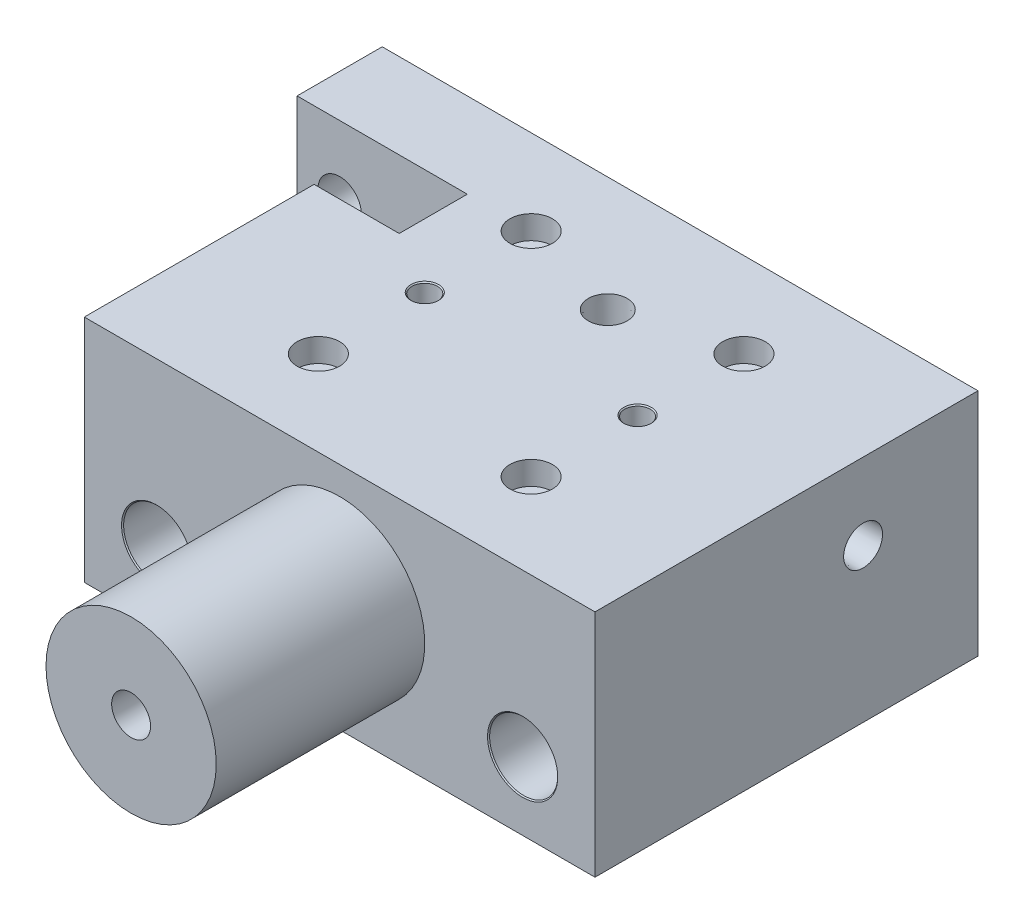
ISO-10303-21;
HEADER;
FILE_DESCRIPTION(('STEP AP214'),'2;1');
FILE_NAME('part.step','',(''),(''),'','','');
FILE_SCHEMA(('AUTOMOTIVE_DESIGN { 1 0 10303 214 1 1 1 1 }'));
ENDSEC;
DATA;
#1=APPLICATION_CONTEXT('core data for automotive mechanical design processes');
#2=APPLICATION_PROTOCOL_DEFINITION('international standard','automotive_design',2000,#1);
#3=PRODUCT_CONTEXT('',#1,'mechanical');
#4=PRODUCT('Part','Part','',(#3));
#5=PRODUCT_RELATED_PRODUCT_CATEGORY('part','',(#4));
#6=PRODUCT_DEFINITION_FORMATION('','',#4);
#7=PRODUCT_DEFINITION_CONTEXT('part definition',#1,'design');
#8=PRODUCT_DEFINITION('design','',#6,#7);
#9=PRODUCT_DEFINITION_SHAPE('','',#8);
#10=(LENGTH_UNIT() NAMED_UNIT(*) SI_UNIT(.MILLI.,.METRE.));
#11=(NAMED_UNIT(*) PLANE_ANGLE_UNIT() SI_UNIT($,.RADIAN.));
#12=(NAMED_UNIT(*) SI_UNIT($,.STERADIAN.) SOLID_ANGLE_UNIT());
#13=UNCERTAINTY_MEASURE_WITH_UNIT(LENGTH_MEASURE(1.E-05),#10,'distance_accuracy_value','');
#14=(GEOMETRIC_REPRESENTATION_CONTEXT(3) GLOBAL_UNCERTAINTY_ASSIGNED_CONTEXT((#13)) GLOBAL_UNIT_ASSIGNED_CONTEXT((#10,
#11,#12)) REPRESENTATION_CONTEXT('',''));
#15=CARTESIAN_POINT('',(0.,0.,0.));
#16=DIRECTION('',(0.,0.,1.));
#17=DIRECTION('',(1.,0.,0.));
#18=AXIS2_PLACEMENT_3D('',#15,#16,#17);
#19=CARTESIAN_POINT('',(0.,4.,-81.));
#20=DIRECTION('',(-1.,0.,0.));
#21=DIRECTION('',(0.,0.,1.));
#22=AXIS2_PLACEMENT_3D('',#19,#20,#21);
#23=CYLINDRICAL_SURFACE('',#22,2.39999999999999);
#24=CARTESIAN_POINT('',(8.99999999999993,4.,-81.));
#25=DIRECTION('',(-1.,0.,0.));
#26=DIRECTION('',(0.,0.,1.));
#27=AXIS2_PLACEMENT_3D('',#24,#25,#26);
#28=CIRCLE('',#27,2.39999999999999);
#29=CARTESIAN_POINT('',(8.99999999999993,4.,-78.6));
#30=VERTEX_POINT('',#29);
#31=EDGE_CURVE('E9355',#30,#30,#28,.T.);
#32=ORIENTED_EDGE('',*,*,#31,.F.);
#33=EDGE_LOOP('',(#32));
#34=FACE_BOUND('',#33,.T.);
#35=CARTESIAN_POINT('',(4.5,4.,-81.));
#36=DIRECTION('',(-1.,0.,0.));
#37=DIRECTION('',(0.,0.,1.));
#38=AXIS2_PLACEMENT_3D('',#35,#36,#37);
#39=CIRCLE('',#38,2.39999999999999);
#40=CARTESIAN_POINT('',(4.5,4.,-78.6));
#41=VERTEX_POINT('',#40);
#42=EDGE_CURVE('E9342',#41,#41,#39,.F.);
#43=ORIENTED_EDGE('',*,*,#42,.F.);
#44=EDGE_LOOP('',(#43));
#45=FACE_BOUND('',#44,.T.);
#46=ADVANCED_FACE('F9174',(#34,#45),#23,.F.);
#47=CARTESIAN_POINT('',(0.,54.,-90.));
#48=DIRECTION('',(1.,0.,0.));
#49=DIRECTION('',(0.,0.,-1.));
#50=AXIS2_PLACEMENT_3D('',#47,#48,#49);
#51=PLANE('',#50);
#52=CARTESIAN_POINT('',(0.,4.,-81.));
#53=DIRECTION('',(-1.,0.,0.));
#54=DIRECTION('',(0.,0.,1.));
#55=AXIS2_PLACEMENT_3D('',#52,#53,#54);
#56=CIRCLE('',#55,4.00000000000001);
#57=CARTESIAN_POINT('',(0.,3.85832158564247,-77.0025098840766));
#58=VERTEX_POINT('',#57);
#59=CARTESIAN_POINT('',(0.,4.,-85.));
#60=VERTEX_POINT('',#59);
#61=EDGE_CURVE('E9321',#58,#60,#56,.T.);
#62=ORIENTED_EDGE('',*,*,#61,.F.);
#63=DIRECTION('',(0.,1.,0.));
#64=VECTOR('',#63,1.);
#65=CARTESIAN_POINT('',(0.,3.85832158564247,-77.0025098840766));
#66=LINE('',#65,#64);
#67=CARTESIAN_POINT('',(0.,0.,-77.0025098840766));
#68=VERTEX_POINT('',#67);
#69=EDGE_CURVE('E9328',#68,#58,#66,.T.);
#70=ORIENTED_EDGE('',*,*,#69,.F.);
#71=DIRECTION('',(0.,0.,1.));
#72=VECTOR('',#71,1.);
#73=CARTESIAN_POINT('',(0.,0.,-90.));
#74=LINE('',#73,#72);
#75=CARTESIAN_POINT('',(0.,0.,-70.));
#76=VERTEX_POINT('',#75);
#77=EDGE_CURVE('E9548',#68,#76,#74,.T.);
#78=ORIENTED_EDGE('',*,*,#77,.T.);
#79=DIRECTION('',(0.,-1.,0.));
#80=VECTOR('',#79,1.);
#81=CARTESIAN_POINT('',(0.,54.,-70.));
#82=LINE('',#81,#80);
#83=CARTESIAN_POINT('',(0.,54.,-70.));
#84=VERTEX_POINT('',#83);
#85=EDGE_CURVE('E9580',#84,#76,#82,.T.);
#86=ORIENTED_EDGE('',*,*,#85,.F.);
#87=DIRECTION('',(0.,0.,1.));
#88=VECTOR('',#87,1.);
#89=CARTESIAN_POINT('',(0.,54.,-90.));
#90=LINE('',#89,#88);
#91=CARTESIAN_POINT('',(0.,54.,-90.));
#92=VERTEX_POINT('',#91);
#93=EDGE_CURVE('E9565',#92,#84,#90,.T.);
#94=ORIENTED_EDGE('',*,*,#93,.F.);
#95=DIRECTION('',(0.,-1.,0.));
#96=VECTOR('',#95,1.);
#97=CARTESIAN_POINT('',(0.,54.,-90.));
#98=LINE('',#97,#96);
#99=CARTESIAN_POINT('',(0.,0.,-90.));
#100=VERTEX_POINT('',#99);
#101=EDGE_CURVE('E9583',#92,#100,#98,.T.);
#102=ORIENTED_EDGE('',*,*,#101,.T.);
#103=CARTESIAN_POINT('',(0.,0.,-85.));
#104=VERTEX_POINT('',#103);
#105=EDGE_CURVE('E9549',#100,#104,#74,.T.);
#106=ORIENTED_EDGE('',*,*,#105,.T.);
#107=DIRECTION('',(0.,-1.,0.));
#108=VECTOR('',#107,1.);
#109=CARTESIAN_POINT('',(0.,4.,-85.));
#110=LINE('',#109,#108);
#111=EDGE_CURVE('E9326',#60,#104,#110,.T.);
#112=ORIENTED_EDGE('',*,*,#111,.F.);
#113=EDGE_LOOP('',(#62,#70,#78,#86,#94,#102,#106,#112));
#114=FACE_BOUND('',#113,.T.);
#115=ADVANCED_FACE('F9645',(#114),#51,.F.);
#116=CARTESIAN_POINT('',(140.,0.,-90.));
#117=DIRECTION('',(0.,-1.,0.));
#118=DIRECTION('',(0.,0.,-1.));
#119=AXIS2_PLACEMENT_3D('',#116,#117,#118);
#120=PLANE('',#119);
#121=DIRECTION('',(-1.,0.,0.));
#122=VECTOR('',#121,1.);
#123=CARTESIAN_POINT('',(4.5,0.,-77.0025098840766));
#124=LINE('',#123,#122);
#125=CARTESIAN_POINT('',(4.5,0.,-77.0025098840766));
#126=VERTEX_POINT('',#125);
#127=EDGE_CURVE('E9343',#126,#68,#124,.T.);
#128=ORIENTED_EDGE('',*,*,#127,.F.);
#129=DIRECTION('',(0.,0.,1.));
#130=VECTOR('',#129,1.);
#131=CARTESIAN_POINT('',(4.5,0.,-85.));
#132=LINE('',#131,#130);
#133=CARTESIAN_POINT('',(4.5,0.,-85.));
#134=VERTEX_POINT('',#133);
#135=EDGE_CURVE('E9334',#134,#126,#132,.T.);
#136=ORIENTED_EDGE('',*,*,#135,.F.);
#137=DIRECTION('',(-1.,0.,0.));
#138=VECTOR('',#137,1.);
#139=CARTESIAN_POINT('',(4.5,0.,-85.));
#140=LINE('',#139,#138);
#141=EDGE_CURVE('E9345',#134,#104,#140,.T.);
#142=ORIENTED_EDGE('',*,*,#141,.T.);
#143=ORIENTED_EDGE('',*,*,#105,.F.);
#144=DIRECTION('',(-1.,0.,0.));
#145=VECTOR('',#144,1.);
#146=CARTESIAN_POINT('',(0.,0.,-90.));
#147=LINE('',#146,#145);
#148=CARTESIAN_POINT('',(8.99999999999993,0.,-90.));
#149=VERTEX_POINT('',#148);
#150=EDGE_CURVE('E9544',#149,#100,#147,.T.);
#151=ORIENTED_EDGE('',*,*,#150,.F.);
#152=DIRECTION('',(0.,0.,-1.));
#153=VECTOR('',#152,1.);
#154=CARTESIAN_POINT('',(8.99999999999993,0.,-69.));
#155=LINE('',#154,#153);
#156=CARTESIAN_POINT('',(8.99999999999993,0.,-70.));
#157=VERTEX_POINT('',#156);
#158=EDGE_CURVE('E9358',#157,#149,#155,.T.);
#159=ORIENTED_EDGE('',*,*,#158,.F.);
#160=DIRECTION('',(1.,0.,0.));
#161=VECTOR('',#160,1.);
#162=CARTESIAN_POINT('',(0.,0.,-70.));
#163=LINE('',#162,#161);
#164=EDGE_CURVE('E9553',#76,#157,#163,.T.);
#165=ORIENTED_EDGE('',*,*,#164,.F.);
#166=ORIENTED_EDGE('',*,*,#77,.F.);
#167=EDGE_LOOP('',(#128,#136,#142,#143,#151,#159,#165,#166));
#168=FACE_BOUND('',#167,.T.);
#169=ADVANCED_FACE('F9652',(#168),#120,.T.);
#170=CARTESIAN_POINT('',(20.,54.,0.));
#171=DIRECTION('',(0.,0.,-1.));
#172=DIRECTION('',(-1.,0.,0.));
#173=AXIS2_PLACEMENT_3D('',#170,#171,#172);
#174=PLANE('',#173);
#175=DIRECTION('',(1.,0.,0.));
#176=VECTOR('',#175,1.);
#177=CARTESIAN_POINT('',(20.,0.,0.));
#178=LINE('',#177,#176);
#179=CARTESIAN_POINT('',(20.,0.,0.));
#180=VERTEX_POINT('',#179);
#181=CARTESIAN_POINT('',(140.,0.,0.));
#182=VERTEX_POINT('',#181);
#183=EDGE_CURVE('E9558',#180,#182,#178,.T.);
#184=ORIENTED_EDGE('',*,*,#183,.T.);
#185=DIRECTION('',(0.,-1.,0.));
#186=VECTOR('',#185,1.);
#187=CARTESIAN_POINT('',(140.,54.,0.));
#188=LINE('',#187,#186);
#189=CARTESIAN_POINT('',(140.,54.,0.));
#190=VERTEX_POINT('',#189);
#191=EDGE_CURVE('E9572',#190,#182,#188,.T.);
#192=ORIENTED_EDGE('',*,*,#191,.F.);
#193=DIRECTION('',(1.,0.,0.));
#194=VECTOR('',#193,1.);
#195=CARTESIAN_POINT('',(20.,54.,0.));
#196=LINE('',#195,#194);
#197=CARTESIAN_POINT('',(20.,54.,0.));
#198=VERTEX_POINT('',#197);
#199=EDGE_CURVE('E9570',#198,#190,#196,.T.);
#200=ORIENTED_EDGE('',*,*,#199,.F.);
#201=DIRECTION('',(0.,-1.,0.));
#202=VECTOR('',#201,1.);
#203=CARTESIAN_POINT('',(20.,54.,0.));
#204=LINE('',#203,#202);
#205=EDGE_CURVE('E9575',#198,#180,#204,.T.);
#206=ORIENTED_EDGE('',*,*,#205,.T.);
#207=EDGE_LOOP('',(#184,#192,#200,#206));
#208=FACE_BOUND('',#207,.T.);
#209=CARTESIAN_POINT('',(37.,16.,0.));
#210=DIRECTION('',(0.,0.,1.));
#211=DIRECTION('',(1.,0.,0.));
#212=AXIS2_PLACEMENT_3D('',#209,#210,#211);
#213=CIRCLE('',#212,8.25);
#214=CARTESIAN_POINT('',(45.25,16.,0.));
#215=VERTEX_POINT('',#214);
#216=EDGE_CURVE('E9526',#215,#215,#213,.T.);
#217=ORIENTED_EDGE('',*,*,#216,.F.);
#218=EDGE_LOOP('',(#217));
#219=FACE_BOUND('',#218,.T.);
#220=CARTESIAN_POINT('',(123.,16.,0.));
#221=DIRECTION('',(0.,0.,1.));
#222=DIRECTION('',(1.,0.,0.));
#223=AXIS2_PLACEMENT_3D('',#220,#221,#222);
#224=CIRCLE('',#223,8.24999999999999);
#225=CARTESIAN_POINT('',(131.25,16.,0.));
#226=VERTEX_POINT('',#225);
#227=EDGE_CURVE('E9514',#226,#226,#224,.T.);
#228=ORIENTED_EDGE('',*,*,#227,.F.);
#229=EDGE_LOOP('',(#228));
#230=FACE_BOUND('',#229,.T.);
#231=CARTESIAN_POINT('',(80.,27.5,0.));
#232=DIRECTION('',(0.,0.,-1.));
#233=DIRECTION('',(-1.,0.,0.));
#234=AXIS2_PLACEMENT_3D('',#231,#232,#233);
#235=CIRCLE('',#234,20.);
#236=CARTESIAN_POINT('',(60.,27.5,0.));
#237=VERTEX_POINT('',#236);
#238=EDGE_CURVE('E9589',#237,#237,#235,.F.);
#239=ORIENTED_EDGE('',*,*,#238,.F.);
#240=EDGE_LOOP('',(#239));
#241=FACE_BOUND('',#240,.T.);
#242=ADVANCED_FACE('F9626',(#208,#219,#230,#241),#174,.F.);
#243=DIRECTION('',(0.,0.,1.));
#244=VECTOR('',#243,1.);
#245=CARTESIAN_POINT('',(10.9999999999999,0.,-69.));
#246=LINE('',#245,#244);
#247=CARTESIAN_POINT('',(10.9999999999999,0.,-90.));
#248=VERTEX_POINT('',#247);
#249=CARTESIAN_POINT('',(10.9999999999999,0.,-70.));
#250=VERTEX_POINT('',#249);
#251=EDGE_CURVE('E9360',#248,#250,#246,.T.);
#252=ORIENTED_EDGE('',*,*,#251,.F.);
#253=CARTESIAN_POINT('',(140.,0.,-90.));
#254=VERTEX_POINT('',#253);
#255=EDGE_CURVE('E9545',#254,#248,#147,.T.);
#256=ORIENTED_EDGE('',*,*,#255,.F.);
#257=DIRECTION('',(0.,0.,-1.));
#258=VECTOR('',#257,1.);
#259=CARTESIAN_POINT('',(140.,0.,0.));
#260=LINE('',#259,#258);
#261=EDGE_CURVE('E9541',#182,#254,#260,.T.);
#262=ORIENTED_EDGE('',*,*,#261,.F.);
#263=ORIENTED_EDGE('',*,*,#183,.F.);
#264=DIRECTION('',(0.,0.,1.));
#265=VECTOR('',#264,1.);
#266=CARTESIAN_POINT('',(19.9999999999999,0.,-70.));
#267=LINE('',#266,#265);
#268=CARTESIAN_POINT('',(19.9999999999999,0.,-70.));
#269=VERTEX_POINT('',#268);
#270=EDGE_CURVE('E9556',#269,#180,#267,.T.);
#271=ORIENTED_EDGE('',*,*,#270,.F.);
#272=EDGE_CURVE('E9552',#250,#269,#163,.T.);
#273=ORIENTED_EDGE('',*,*,#272,.F.);
#274=EDGE_LOOP('',(#252,#256,#262,#263,#271,#273));
#275=FACE_BOUND('',#274,.T.);
#276=CARTESIAN_POINT('',(80.,0.,-63.));
#277=DIRECTION('',(0.,-1.,0.));
#278=DIRECTION('',(0.,0.,-1.));
#279=AXIS2_PLACEMENT_3D('',#276,#277,#278);
#280=CIRCLE('',#279,4.57349999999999);
#281=CARTESIAN_POINT('',(80.,0.,-67.5735));
#282=VERTEX_POINT('',#281);
#283=EDGE_CURVE('E9422',#282,#282,#280,.T.);
#284=ORIENTED_EDGE('',*,*,#283,.F.);
#285=EDGE_LOOP('',(#284));
#286=FACE_BOUND('',#285,.T.);
#287=CARTESIAN_POINT('',(55.,0.,-20.));
#288=DIRECTION('',(0.,-1.,0.));
#289=DIRECTION('',(0.,0.,-1.));
#290=AXIS2_PLACEMENT_3D('',#287,#288,#289);
#291=CIRCLE('',#290,5.);
#292=CARTESIAN_POINT('',(55.,0.,-25.));
#293=VERTEX_POINT('',#292);
#294=EDGE_CURVE('E9425',#293,#293,#291,.T.);
#295=ORIENTED_EDGE('',*,*,#294,.F.);
#296=EDGE_LOOP('',(#295));
#297=FACE_BOUND('',#296,.T.);
#298=CARTESIAN_POINT('',(55.,0.,-70.));
#299=DIRECTION('',(0.,-1.,0.));
#300=DIRECTION('',(0.,0.,-1.));
#301=AXIS2_PLACEMENT_3D('',#298,#299,#300);
#302=CIRCLE('',#301,5.);
#303=CARTESIAN_POINT('',(55.,0.,-75.));
#304=VERTEX_POINT('',#303);
#305=EDGE_CURVE('E9453',#304,#304,#302,.T.);
#306=ORIENTED_EDGE('',*,*,#305,.F.);
#307=EDGE_LOOP('',(#306));
#308=FACE_BOUND('',#307,.T.);
#309=CARTESIAN_POINT('',(105.,0.,-45.));
#310=DIRECTION('',(0.,-1.,0.));
#311=DIRECTION('',(0.,0.,-1.));
#312=AXIS2_PLACEMENT_3D('',#309,#310,#311);
#313=CIRCLE('',#312,3.25);
#314=CARTESIAN_POINT('',(105.,0.,-48.25));
#315=VERTEX_POINT('',#314);
#316=EDGE_CURVE('E9490',#315,#315,#313,.T.);
#317=ORIENTED_EDGE('',*,*,#316,.F.);
#318=EDGE_LOOP('',(#317));
#319=FACE_BOUND('',#318,.T.);
#320=CARTESIAN_POINT('',(55.,0.,-45.));
#321=DIRECTION('',(0.,-1.,0.));
#322=DIRECTION('',(0.,0.,-1.));
#323=AXIS2_PLACEMENT_3D('',#320,#321,#322);
#324=CIRCLE('',#323,3.25);
#325=CARTESIAN_POINT('',(55.,0.,-48.25));
#326=VERTEX_POINT('',#325);
#327=EDGE_CURVE('E9502',#326,#326,#324,.T.);
#328=ORIENTED_EDGE('',*,*,#327,.F.);
#329=EDGE_LOOP('',(#328));
#330=FACE_BOUND('',#329,.T.);
#331=CARTESIAN_POINT('',(105.,0.,-70.));
#332=DIRECTION('',(0.,-1.,0.));
#333=DIRECTION('',(0.,0.,-1.));
#334=AXIS2_PLACEMENT_3D('',#331,#332,#333);
#335=CIRCLE('',#334,5.);
#336=CARTESIAN_POINT('',(105.,0.,-75.));
#337=VERTEX_POINT('',#336);
#338=EDGE_CURVE('E9467',#337,#337,#335,.T.);
#339=ORIENTED_EDGE('',*,*,#338,.F.);
#340=EDGE_LOOP('',(#339));
#341=FACE_BOUND('',#340,.T.);
#342=CARTESIAN_POINT('',(105.,0.,-20.));
#343=DIRECTION('',(0.,-1.,0.));
#344=DIRECTION('',(0.,0.,-1.));
#345=AXIS2_PLACEMENT_3D('',#342,#343,#344);
#346=CIRCLE('',#345,5.);
#347=CARTESIAN_POINT('',(105.,0.,-25.));
#348=VERTEX_POINT('',#347);
#349=EDGE_CURVE('E9439',#348,#348,#346,.T.);
#350=ORIENTED_EDGE('',*,*,#349,.F.);
#351=EDGE_LOOP('',(#350));
#352=FACE_BOUND('',#351,.T.);
#353=ADVANCED_FACE('F9631',(#275,#286,#297,#308,#319,#330,#341,#352),#120,.T.);
#354=CARTESIAN_POINT('',(140.,54.,0.));
#355=DIRECTION('',(-1.,0.,0.));
#356=DIRECTION('',(0.,0.,1.));
#357=AXIS2_PLACEMENT_3D('',#354,#355,#356);
#358=PLANE('',#357);
#359=CARTESIAN_POINT('',(140.,36.,-63.));
#360=DIRECTION('',(1.,0.,0.));
#361=DIRECTION('',(0.,0.,-1.));
#362=AXIS2_PLACEMENT_3D('',#359,#360,#361);
#363=CIRCLE('',#362,4.5735);
#364=CARTESIAN_POINT('',(140.,36.,-67.5735));
#365=VERTEX_POINT('',#364);
#366=EDGE_CURVE('E9398',#365,#365,#363,.T.);
#367=ORIENTED_EDGE('',*,*,#366,.F.);
#368=EDGE_LOOP('',(#367));
#369=FACE_BOUND('',#368,.T.);
#370=ORIENTED_EDGE('',*,*,#261,.T.);
#371=DIRECTION('',(0.,-1.,0.));
#372=VECTOR('',#371,1.);
#373=CARTESIAN_POINT('',(140.,54.,-90.));
#374=LINE('',#373,#372);
#375=CARTESIAN_POINT('',(140.,54.,-90.));
#376=VERTEX_POINT('',#375);
#377=EDGE_CURVE('E9586',#376,#254,#374,.T.);
#378=ORIENTED_EDGE('',*,*,#377,.F.);
#379=DIRECTION('',(0.,0.,-1.));
#380=VECTOR('',#379,1.);
#381=CARTESIAN_POINT('',(140.,54.,0.));
#382=LINE('',#381,#380);
#383=EDGE_CURVE('E9560',#190,#376,#382,.T.);
#384=ORIENTED_EDGE('',*,*,#383,.F.);
#385=ORIENTED_EDGE('',*,*,#191,.T.);
#386=EDGE_LOOP('',(#370,#378,#384,#385));
#387=FACE_BOUND('',#386,.T.);
#388=ADVANCED_FACE('F9176',(#369,#387),#358,.F.);
#389=CARTESIAN_POINT('',(0.,54.,-90.));
#390=DIRECTION('',(0.,0.,1.));
#391=DIRECTION('',(1.,0.,0.));
#392=AXIS2_PLACEMENT_3D('',#389,#390,#391);
#393=PLANE('',#392);
#394=CARTESIAN_POINT('',(123.,16.,-90.));
#395=DIRECTION('',(0.,0.,1.));
#396=DIRECTION('',(1.,0.,0.));
#397=AXIS2_PLACEMENT_3D('',#394,#395,#396);
#398=CIRCLE('',#397,8.24999999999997);
#399=CARTESIAN_POINT('',(131.25,16.,-90.));
#400=VERTEX_POINT('',#399);
#401=EDGE_CURVE('E9505',#400,#400,#398,.T.);
#402=ORIENTED_EDGE('',*,*,#401,.T.);
#403=EDGE_LOOP('',(#402));
#404=FACE_BOUND('',#403,.T.);
#405=CARTESIAN_POINT('',(37.,16.,-90.));
#406=DIRECTION('',(0.,0.,1.));
#407=DIRECTION('',(1.,0.,0.));
#408=AXIS2_PLACEMENT_3D('',#405,#406,#407);
#409=CIRCLE('',#408,8.24999999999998);
#410=CARTESIAN_POINT('',(45.25,16.,-90.));
#411=VERTEX_POINT('',#410);
#412=EDGE_CURVE('E9517',#411,#411,#409,.T.);
#413=ORIENTED_EDGE('',*,*,#412,.T.);
#414=EDGE_LOOP('',(#413));
#415=FACE_BOUND('',#414,.T.);
#416=CARTESIAN_POINT('',(9.99999999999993,37.5,-90.));
#417=DIRECTION('',(0.,0.,1.));
#418=DIRECTION('',(1.,0.,0.));
#419=AXIS2_PLACEMENT_3D('',#416,#417,#418);
#420=CIRCLE('',#419,5.1);
#421=CARTESIAN_POINT('',(15.0999999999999,37.5,-90.));
#422=VERTEX_POINT('',#421);
#423=EDGE_CURVE('E9529',#422,#422,#420,.T.);
#424=ORIENTED_EDGE('',*,*,#423,.T.);
#425=EDGE_LOOP('',(#424));
#426=FACE_BOUND('',#425,.T.);
#427=CARTESIAN_POINT('',(9.99999999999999,13.5,-90.));
#428=DIRECTION('',(0.,0.,1.));
#429=DIRECTION('',(1.,0.,0.));
#430=AXIS2_PLACEMENT_3D('',#427,#428,#429);
#431=CIRCLE('',#430,6.);
#432=CARTESIAN_POINT('',(10.9999999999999,7.58392021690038,-90.));
#433=VERTEX_POINT('',#432);
#434=CARTESIAN_POINT('',(8.99999999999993,7.5839202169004,-90.));
#435=VERTEX_POINT('',#434);
#436=EDGE_CURVE('E9535',#433,#435,#431,.T.);
#437=ORIENTED_EDGE('',*,*,#436,.T.);
#438=DIRECTION('',(0.,-1.,0.));
#439=VECTOR('',#438,1.);
#440=CARTESIAN_POINT('',(8.99999999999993,54.,-90.));
#441=LINE('',#440,#439);
#442=EDGE_CURVE('E9371',#435,#149,#441,.T.);
#443=ORIENTED_EDGE('',*,*,#442,.T.);
#444=ORIENTED_EDGE('',*,*,#150,.T.);
#445=ORIENTED_EDGE('',*,*,#101,.F.);
#446=DIRECTION('',(-1.,0.,0.));
#447=VECTOR('',#446,1.);
#448=CARTESIAN_POINT('',(0.,54.,-90.));
#449=LINE('',#448,#447);
#450=EDGE_CURVE('E9563',#376,#92,#449,.T.);
#451=ORIENTED_EDGE('',*,*,#450,.F.);
#452=ORIENTED_EDGE('',*,*,#377,.T.);
#453=ORIENTED_EDGE('',*,*,#255,.T.);
#454=DIRECTION('',(0.,1.,0.));
#455=VECTOR('',#454,1.);
#456=CARTESIAN_POINT('',(10.9999999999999,54.,-90.));
#457=LINE('',#456,#455);
#458=EDGE_CURVE('E9365',#248,#433,#457,.T.);
#459=ORIENTED_EDGE('',*,*,#458,.T.);
#460=EDGE_LOOP('',(#437,#443,#444,#445,#451,#452,#453,#459));
#461=FACE_BOUND('',#460,.T.);
#462=ADVANCED_FACE('F9640',(#404,#415,#426,#461),#393,.F.);
#463=CARTESIAN_POINT('',(0.,54.,-70.));
#464=DIRECTION('',(0.,0.,-1.));
#465=DIRECTION('',(-1.,0.,0.));
#466=AXIS2_PLACEMENT_3D('',#463,#464,#465);
#467=PLANE('',#466);
#468=CARTESIAN_POINT('',(9.99999999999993,37.5,-70.));
#469=DIRECTION('',(0.,0.,1.));
#470=DIRECTION('',(1.,0.,0.));
#471=AXIS2_PLACEMENT_3D('',#468,#469,#470);
#472=CIRCLE('',#471,5.1);
#473=CARTESIAN_POINT('',(15.0999999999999,37.5,-70.));
#474=VERTEX_POINT('',#473);
#475=EDGE_CURVE('E9532',#474,#474,#472,.T.);
#476=ORIENTED_EDGE('',*,*,#475,.F.);
#477=EDGE_LOOP('',(#476));
#478=FACE_BOUND('',#477,.T.);
#479=DIRECTION('',(0.,-1.,0.));
#480=VECTOR('',#479,1.);
#481=CARTESIAN_POINT('',(19.9999999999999,54.,-70.));
#482=LINE('',#481,#480);
#483=CARTESIAN_POINT('',(19.9999999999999,34.,-70.));
#484=VERTEX_POINT('',#483);
#485=EDGE_CURVE('E9578',#484,#269,#482,.T.);
#486=ORIENTED_EDGE('',*,*,#485,.F.);
#487=DIRECTION('',(-0.707106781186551,-0.707106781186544,0.));
#488=VECTOR('',#487,1.);
#489=CARTESIAN_POINT('',(19.9999999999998,34.,-70.));
#490=LINE('',#489,#488);
#491=CARTESIAN_POINT('',(39.9999999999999,54.,-70.));
#492=VERTEX_POINT('',#491);
#493=EDGE_CURVE('E9182',#484,#492,#490,.F.);
#494=ORIENTED_EDGE('',*,*,#493,.T.);
#495=DIRECTION('',(1.,0.,0.));
#496=VECTOR('',#495,1.);
#497=CARTESIAN_POINT('',(0.,54.,-70.));
#498=LINE('',#497,#496);
#499=EDGE_CURVE('E9311',#84,#492,#498,.T.);
#500=ORIENTED_EDGE('',*,*,#499,.F.);
#501=ORIENTED_EDGE('',*,*,#85,.T.);
#502=ORIENTED_EDGE('',*,*,#164,.T.);
#503=DIRECTION('',(0.,1.,0.));
#504=VECTOR('',#503,1.);
#505=CARTESIAN_POINT('',(8.99999999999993,54.,-70.));
#506=LINE('',#505,#504);
#507=CARTESIAN_POINT('',(8.99999999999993,7.5839202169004,-70.));
#508=VERTEX_POINT('',#507);
#509=EDGE_CURVE('E9368',#157,#508,#506,.T.);
#510=ORIENTED_EDGE('',*,*,#509,.T.);
#511=CARTESIAN_POINT('',(9.99999999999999,13.5,-70.));
#512=DIRECTION('',(0.,0.,1.));
#513=DIRECTION('',(1.,0.,0.));
#514=AXIS2_PLACEMENT_3D('',#511,#512,#513);
#515=CIRCLE('',#514,6.);
#516=CARTESIAN_POINT('',(10.9999999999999,7.58392021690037,-70.));
#517=VERTEX_POINT('',#516);
#518=EDGE_CURVE('E9538',#517,#508,#515,.T.);
#519=ORIENTED_EDGE('',*,*,#518,.F.);
#520=DIRECTION('',(0.,-1.,0.));
#521=VECTOR('',#520,1.);
#522=CARTESIAN_POINT('',(10.9999999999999,54.,-70.));
#523=LINE('',#522,#521);
#524=EDGE_CURVE('E9362',#517,#250,#523,.T.);
#525=ORIENTED_EDGE('',*,*,#524,.T.);
#526=ORIENTED_EDGE('',*,*,#272,.T.);
#527=EDGE_LOOP('',(#486,#494,#500,#501,#502,#510,#519,#525,#526));
#528=FACE_BOUND('',#527,.T.);
#529=ADVANCED_FACE('F9616',(#478,#528),#467,.F.);
#530=CARTESIAN_POINT('',(19.9999999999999,54.,-70.));
#531=DIRECTION('',(1.,0.,0.));
#532=DIRECTION('',(0.,0.,-1.));
#533=AXIS2_PLACEMENT_3D('',#530,#531,#532);
#534=PLANE('',#533);
#535=DIRECTION('',(0.,0.,1.));
#536=VECTOR('',#535,1.);
#537=CARTESIAN_POINT('',(19.9999999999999,54.,-70.));
#538=LINE('',#537,#536);
#539=CARTESIAN_POINT('',(19.9999999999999,54.,-54.));
#540=VERTEX_POINT('',#539);
#541=EDGE_CURVE('E9568',#540,#198,#538,.T.);
#542=ORIENTED_EDGE('',*,*,#541,.F.);
#543=DIRECTION('',(0.,1.,0.));
#544=VECTOR('',#543,1.);
#545=CARTESIAN_POINT('',(19.9999999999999,34.,-54.));
#546=LINE('',#545,#544);
#547=CARTESIAN_POINT('',(19.9999999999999,34.,-54.));
#548=VERTEX_POINT('',#547);
#549=EDGE_CURVE('E9188',#548,#540,#546,.T.);
#550=ORIENTED_EDGE('',*,*,#549,.F.);
#551=DIRECTION('',(0.,0.,1.));
#552=VECTOR('',#551,1.);
#553=CARTESIAN_POINT('',(19.9999999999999,34.,-54.));
#554=LINE('',#553,#552);
#555=EDGE_CURVE('E9313',#484,#548,#554,.T.);
#556=ORIENTED_EDGE('',*,*,#555,.F.);
#557=ORIENTED_EDGE('',*,*,#485,.T.);
#558=ORIENTED_EDGE('',*,*,#270,.T.);
#559=ORIENTED_EDGE('',*,*,#205,.F.);
#560=EDGE_LOOP('',(#542,#550,#556,#557,#558,#559));
#561=FACE_BOUND('',#560,.T.);
#562=ADVANCED_FACE('F9620',(#561),#534,.F.);
#563=CARTESIAN_POINT('',(140.,54.,-90.));
#564=DIRECTION('',(0.,-1.,0.));
#565=DIRECTION('',(0.,0.,-1.));
#566=AXIS2_PLACEMENT_3D('',#563,#564,#565);
#567=PLANE('',#566);
#568=CARTESIAN_POINT('',(80.,54.,-63.));
#569=DIRECTION('',(0.,1.,0.));
#570=DIRECTION('',(0.,0.,1.));
#571=AXIS2_PLACEMENT_3D('',#568,#569,#570);
#572=CIRCLE('',#571,4.57349999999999);
#573=CARTESIAN_POINT('',(80.,54.,-58.4265));
#574=VERTEX_POINT('',#573);
#575=EDGE_CURVE('E9401',#574,#574,#572,.T.);
#576=ORIENTED_EDGE('',*,*,#575,.F.);
#577=EDGE_LOOP('',(#576));
#578=FACE_BOUND('',#577,.T.);
#579=CARTESIAN_POINT('',(55.,54.,-20.));
#580=DIRECTION('',(0.,1.,0.));
#581=DIRECTION('',(0.,0.,1.));
#582=AXIS2_PLACEMENT_3D('',#579,#580,#581);
#583=CIRCLE('',#582,5.);
#584=CARTESIAN_POINT('',(55.,54.,-15.));
#585=VERTEX_POINT('',#584);
#586=EDGE_CURVE('E9432',#585,#585,#583,.T.);
#587=ORIENTED_EDGE('',*,*,#586,.F.);
#588=EDGE_LOOP('',(#587));
#589=FACE_BOUND('',#588,.T.);
#590=CARTESIAN_POINT('',(105.,54.,-20.));
#591=DIRECTION('',(0.,1.,0.));
#592=DIRECTION('',(0.,0.,1.));
#593=AXIS2_PLACEMENT_3D('',#590,#591,#592);
#594=CIRCLE('',#593,5.);
#595=CARTESIAN_POINT('',(105.,54.,-15.));
#596=VERTEX_POINT('',#595);
#597=EDGE_CURVE('E9446',#596,#596,#594,.T.);
#598=ORIENTED_EDGE('',*,*,#597,.F.);
#599=EDGE_LOOP('',(#598));
#600=FACE_BOUND('',#599,.T.);
#601=CARTESIAN_POINT('',(55.,54.,-70.));
#602=DIRECTION('',(0.,1.,0.));
#603=DIRECTION('',(0.,0.,1.));
#604=AXIS2_PLACEMENT_3D('',#601,#602,#603);
#605=CIRCLE('',#604,5.);
#606=CARTESIAN_POINT('',(55.,54.,-65.));
#607=VERTEX_POINT('',#606);
#608=EDGE_CURVE('E9460',#607,#607,#605,.T.);
#609=ORIENTED_EDGE('',*,*,#608,.F.);
#610=EDGE_LOOP('',(#609));
#611=FACE_BOUND('',#610,.T.);
#612=CARTESIAN_POINT('',(105.,54.,-70.));
#613=DIRECTION('',(0.,1.,0.));
#614=DIRECTION('',(0.,0.,1.));
#615=AXIS2_PLACEMENT_3D('',#612,#613,#614);
#616=CIRCLE('',#615,5.);
#617=CARTESIAN_POINT('',(105.,54.,-65.));
#618=VERTEX_POINT('',#617);
#619=EDGE_CURVE('E9477',#618,#618,#616,.T.);
#620=ORIENTED_EDGE('',*,*,#619,.F.);
#621=EDGE_LOOP('',(#620));
#622=FACE_BOUND('',#621,.T.);
#623=CARTESIAN_POINT('',(105.,54.,-45.));
#624=DIRECTION('',(0.,-1.,0.));
#625=DIRECTION('',(0.,0.,-1.));
#626=AXIS2_PLACEMENT_3D('',#623,#624,#625);
#627=CIRCLE('',#626,3.24999999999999);
#628=CARTESIAN_POINT('',(105.,54.,-48.25));
#629=VERTEX_POINT('',#628);
#630=EDGE_CURVE('E9481',#629,#629,#627,.T.);
#631=ORIENTED_EDGE('',*,*,#630,.T.);
#632=EDGE_LOOP('',(#631));
#633=FACE_BOUND('',#632,.T.);
#634=CARTESIAN_POINT('',(55.,54.,-45.));
#635=DIRECTION('',(0.,-1.,0.));
#636=DIRECTION('',(0.,0.,-1.));
#637=AXIS2_PLACEMENT_3D('',#634,#635,#636);
#638=CIRCLE('',#637,3.24999999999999);
#639=CARTESIAN_POINT('',(55.,54.,-48.25));
#640=VERTEX_POINT('',#639);
#641=EDGE_CURVE('E9493',#640,#640,#638,.T.);
#642=ORIENTED_EDGE('',*,*,#641,.T.);
#643=EDGE_LOOP('',(#642));
#644=FACE_BOUND('',#643,.T.);
#645=ORIENTED_EDGE('',*,*,#499,.T.);
#646=DIRECTION('',(0.,0.,-1.));
#647=VECTOR('',#646,1.);
#648=CARTESIAN_POINT('',(39.9999999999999,54.,-70.));
#649=LINE('',#648,#647);
#650=CARTESIAN_POINT('',(39.9999999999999,54.,-54.));
#651=VERTEX_POINT('',#650);
#652=EDGE_CURVE('E9305',#651,#492,#649,.T.);
#653=ORIENTED_EDGE('',*,*,#652,.F.);
#654=DIRECTION('',(1.,0.,0.));
#655=VECTOR('',#654,1.);
#656=CARTESIAN_POINT('',(39.9999999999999,54.,-54.));
#657=LINE('',#656,#655);
#658=EDGE_CURVE('E9299',#540,#651,#657,.T.);
#659=ORIENTED_EDGE('',*,*,#658,.F.);
#660=ORIENTED_EDGE('',*,*,#541,.T.);
#661=ORIENTED_EDGE('',*,*,#199,.T.);
#662=ORIENTED_EDGE('',*,*,#383,.T.);
#663=ORIENTED_EDGE('',*,*,#450,.T.);
#664=ORIENTED_EDGE('',*,*,#93,.T.);
#665=EDGE_LOOP('',(#645,#653,#659,#660,#661,#662,#663,#664));
#666=FACE_BOUND('',#665,.T.);
#667=ADVANCED_FACE('F9309',(#578,#589,#600,#611,#622,#633,#644,#666),#567,.F.);
#668=CARTESIAN_POINT('',(9.99999999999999,13.5,-70.));
#669=DIRECTION('',(0.,0.,1.));
#670=DIRECTION('',(1.,0.,0.));
#671=AXIS2_PLACEMENT_3D('',#668,#669,#670);
#672=CYLINDRICAL_SURFACE('',#671,6.);
#673=ORIENTED_EDGE('',*,*,#518,.T.);
#674=DIRECTION('',(0.,0.,1.));
#675=VECTOR('',#674,1.);
#676=CARTESIAN_POINT('',(8.99999999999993,7.5839202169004,-70.));
#677=LINE('',#676,#675);
#678=EDGE_CURVE('E9611',#508,#435,#677,.F.);
#679=ORIENTED_EDGE('',*,*,#678,.T.);
#680=ORIENTED_EDGE('',*,*,#436,.F.);
#681=DIRECTION('',(0.,0.,1.));
#682=VECTOR('',#681,1.);
#683=CARTESIAN_POINT('',(10.9999999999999,7.58392021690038,-70.));
#684=LINE('',#683,#682);
#685=EDGE_CURVE('E9608',#433,#517,#684,.T.);
#686=ORIENTED_EDGE('',*,*,#685,.T.);
#687=EDGE_LOOP('',(#673,#679,#680,#686));
#688=FACE_BOUND('',#687,.T.);
#689=ADVANCED_FACE('F9657',(#688),#672,.F.);
#690=CARTESIAN_POINT('',(9.99999999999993,37.5,-70.));
#691=DIRECTION('',(0.,0.,1.));
#692=DIRECTION('',(1.,0.,0.));
#693=AXIS2_PLACEMENT_3D('',#690,#691,#692);
#694=CYLINDRICAL_SURFACE('',#693,5.1);
#695=ORIENTED_EDGE('',*,*,#423,.F.);
#696=EDGE_LOOP('',(#695));
#697=FACE_BOUND('',#696,.T.);
#698=ORIENTED_EDGE('',*,*,#475,.T.);
#699=EDGE_LOOP('',(#698));
#700=FACE_BOUND('',#699,.T.);
#701=ADVANCED_FACE('F9789',(#697,#700),#694,.F.);
#702=CARTESIAN_POINT('',(37.,16.,0.));
#703=DIRECTION('',(0.,0.,1.));
#704=DIRECTION('',(1.,0.,0.));
#705=AXIS2_PLACEMENT_3D('',#702,#703,#704);
#706=CONICAL_SURFACE('',#705,8.25,0.785398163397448);
#707=CARTESIAN_POINT('',(37.,16.,-0.250000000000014));
#708=DIRECTION('',(0.,0.,1.));
#709=DIRECTION('',(1.,0.,0.));
#710=AXIS2_PLACEMENT_3D('',#707,#708,#709);
#711=CIRCLE('',#710,7.99999999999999);
#712=CARTESIAN_POINT('',(45.,16.,-0.250000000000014));
#713=VERTEX_POINT('',#712);
#714=EDGE_CURVE('E9523',#713,#713,#711,.T.);
#715=ORIENTED_EDGE('',*,*,#714,.F.);
#716=EDGE_LOOP('',(#715));
#717=FACE_BOUND('',#716,.T.);
#718=ORIENTED_EDGE('',*,*,#216,.T.);
#719=EDGE_LOOP('',(#718));
#720=FACE_BOUND('',#719,.T.);
#721=ADVANCED_FACE('F10199',(#717,#720),#706,.F.);
#722=CARTESIAN_POINT('',(37.,16.,0.));
#723=DIRECTION('',(0.,0.,1.));
#724=DIRECTION('',(1.,0.,0.));
#725=AXIS2_PLACEMENT_3D('',#722,#723,#724);
#726=CYLINDRICAL_SURFACE('',#725,7.99999999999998);
#727=CARTESIAN_POINT('',(37.,16.,-89.75));
#728=DIRECTION('',(0.,0.,1.));
#729=DIRECTION('',(1.,0.,0.));
#730=AXIS2_PLACEMENT_3D('',#727,#728,#729);
#731=CIRCLE('',#730,7.99999999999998);
#732=CARTESIAN_POINT('',(45.,16.,-89.75));
#733=VERTEX_POINT('',#732);
#734=EDGE_CURVE('E9520',#733,#733,#731,.T.);
#735=ORIENTED_EDGE('',*,*,#734,.F.);
#736=EDGE_LOOP('',(#735));
#737=FACE_BOUND('',#736,.T.);
#738=ORIENTED_EDGE('',*,*,#714,.T.);
#739=EDGE_LOOP('',(#738));
#740=FACE_BOUND('',#739,.T.);
#741=ADVANCED_FACE('F10191',(#737,#740),#726,.F.);
#742=CARTESIAN_POINT('',(37.,16.,-89.75));
#743=DIRECTION('',(0.,0.,-1.));
#744=DIRECTION('',(-1.,0.,0.));
#745=AXIS2_PLACEMENT_3D('',#742,#743,#744);
#746=CONICAL_SURFACE('',#745,7.99999999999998,0.785398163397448);
#747=ORIENTED_EDGE('',*,*,#412,.F.);
#748=EDGE_LOOP('',(#747));
#749=FACE_BOUND('',#748,.T.);
#750=ORIENTED_EDGE('',*,*,#734,.T.);
#751=EDGE_LOOP('',(#750));
#752=FACE_BOUND('',#751,.T.);
#753=ADVANCED_FACE('F10183',(#749,#752),#746,.F.);
#754=CARTESIAN_POINT('',(123.,16.,0.));
#755=DIRECTION('',(0.,0.,1.));
#756=DIRECTION('',(1.,0.,0.));
#757=AXIS2_PLACEMENT_3D('',#754,#755,#756);
#758=CONICAL_SURFACE('',#757,8.24999999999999,0.785398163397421);
#759=CARTESIAN_POINT('',(123.,16.,-0.250000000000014));
#760=DIRECTION('',(0.,0.,1.));
#761=DIRECTION('',(1.,0.,0.));
#762=AXIS2_PLACEMENT_3D('',#759,#760,#761);
#763=CIRCLE('',#762,7.99999999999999);
#764=CARTESIAN_POINT('',(131.,16.,-0.250000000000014));
#765=VERTEX_POINT('',#764);
#766=EDGE_CURVE('E9511',#765,#765,#763,.T.);
#767=ORIENTED_EDGE('',*,*,#766,.F.);
#768=EDGE_LOOP('',(#767));
#769=FACE_BOUND('',#768,.T.);
#770=ORIENTED_EDGE('',*,*,#227,.T.);
#771=EDGE_LOOP('',(#770));
#772=FACE_BOUND('',#771,.T.);
#773=ADVANCED_FACE('F10175',(#769,#772),#758,.F.);
#774=CARTESIAN_POINT('',(123.,16.,0.));
#775=DIRECTION('',(0.,0.,1.));
#776=DIRECTION('',(1.,0.,0.));
#777=AXIS2_PLACEMENT_3D('',#774,#775,#776);
#778=CYLINDRICAL_SURFACE('',#777,7.99999999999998);
#779=CARTESIAN_POINT('',(123.,16.,-89.75));
#780=DIRECTION('',(0.,0.,1.));
#781=DIRECTION('',(1.,0.,0.));
#782=AXIS2_PLACEMENT_3D('',#779,#780,#781);
#783=CIRCLE('',#782,7.99999999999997);
#784=CARTESIAN_POINT('',(131.,16.,-89.75));
#785=VERTEX_POINT('',#784);
#786=EDGE_CURVE('E9508',#785,#785,#783,.T.);
#787=ORIENTED_EDGE('',*,*,#786,.F.);
#788=EDGE_LOOP('',(#787));
#789=FACE_BOUND('',#788,.T.);
#790=ORIENTED_EDGE('',*,*,#766,.T.);
#791=EDGE_LOOP('',(#790));
#792=FACE_BOUND('',#791,.T.);
#793=ADVANCED_FACE('F10167',(#789,#792),#778,.F.);
#794=CARTESIAN_POINT('',(123.,16.,-89.75));
#795=DIRECTION('',(0.,0.,-1.));
#796=DIRECTION('',(-1.,0.,0.));
#797=AXIS2_PLACEMENT_3D('',#794,#795,#796);
#798=CONICAL_SURFACE('',#797,7.99999999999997,0.785398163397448);
#799=ORIENTED_EDGE('',*,*,#401,.F.);
#800=EDGE_LOOP('',(#799));
#801=FACE_BOUND('',#800,.T.);
#802=ORIENTED_EDGE('',*,*,#786,.T.);
#803=EDGE_LOOP('',(#802));
#804=FACE_BOUND('',#803,.T.);
#805=ADVANCED_FACE('F10159',(#801,#804),#798,.F.);
#806=CARTESIAN_POINT('',(55.,0.,-45.));
#807=DIRECTION('',(0.,-1.,0.));
#808=DIRECTION('',(0.,0.,-1.));
#809=AXIS2_PLACEMENT_3D('',#806,#807,#808);
#810=CONICAL_SURFACE('',#809,3.25,0.785398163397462);
#811=CARTESIAN_POINT('',(55.,0.25,-45.));
#812=DIRECTION('',(0.,-1.,0.));
#813=DIRECTION('',(0.,0.,-1.));
#814=AXIS2_PLACEMENT_3D('',#811,#812,#813);
#815=CIRCLE('',#814,3.);
#816=CARTESIAN_POINT('',(55.,0.25,-48.));
#817=VERTEX_POINT('',#816);
#818=EDGE_CURVE('E9499',#817,#817,#815,.T.);
#819=ORIENTED_EDGE('',*,*,#818,.F.);
#820=EDGE_LOOP('',(#819));
#821=FACE_BOUND('',#820,.T.);
#822=ORIENTED_EDGE('',*,*,#327,.T.);
#823=EDGE_LOOP('',(#822));
#824=FACE_BOUND('',#823,.T.);
#825=ADVANCED_FACE('F10151',(#821,#824),#810,.F.);
#826=CARTESIAN_POINT('',(55.,0.,-45.));
#827=DIRECTION('',(0.,-1.,0.));
#828=DIRECTION('',(0.,0.,-1.));
#829=AXIS2_PLACEMENT_3D('',#826,#827,#828);
#830=CYLINDRICAL_SURFACE('',#829,2.99999999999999);
#831=CARTESIAN_POINT('',(55.,53.75,-45.));
#832=DIRECTION('',(0.,-1.,0.));
#833=DIRECTION('',(0.,0.,-1.));
#834=AXIS2_PLACEMENT_3D('',#831,#832,#833);
#835=CIRCLE('',#834,2.99999999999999);
#836=CARTESIAN_POINT('',(55.,53.75,-48.));
#837=VERTEX_POINT('',#836);
#838=EDGE_CURVE('E9496',#837,#837,#835,.T.);
#839=ORIENTED_EDGE('',*,*,#838,.F.);
#840=EDGE_LOOP('',(#839));
#841=FACE_BOUND('',#840,.T.);
#842=ORIENTED_EDGE('',*,*,#818,.T.);
#843=EDGE_LOOP('',(#842));
#844=FACE_BOUND('',#843,.T.);
#845=ADVANCED_FACE('F10143',(#841,#844),#830,.F.);
#846=CARTESIAN_POINT('',(55.,53.75,-45.));
#847=DIRECTION('',(0.,1.,0.));
#848=DIRECTION('',(0.,0.,1.));
#849=AXIS2_PLACEMENT_3D('',#846,#847,#848);
#850=CONICAL_SURFACE('',#849,2.99999999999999,0.785398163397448);
#851=ORIENTED_EDGE('',*,*,#641,.F.);
#852=EDGE_LOOP('',(#851));
#853=FACE_BOUND('',#852,.T.);
#854=ORIENTED_EDGE('',*,*,#838,.T.);
#855=EDGE_LOOP('',(#854));
#856=FACE_BOUND('',#855,.T.);
#857=ADVANCED_FACE('F10135',(#853,#856),#850,.F.);
#858=CARTESIAN_POINT('',(105.,0.,-45.));
#859=DIRECTION('',(0.,-1.,0.));
#860=DIRECTION('',(0.,0.,-1.));
#861=AXIS2_PLACEMENT_3D('',#858,#859,#860);
#862=CONICAL_SURFACE('',#861,3.25,0.785398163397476);
#863=CARTESIAN_POINT('',(105.,0.25,-45.));
#864=DIRECTION('',(0.,-1.,0.));
#865=DIRECTION('',(0.,0.,-1.));
#866=AXIS2_PLACEMENT_3D('',#863,#864,#865);
#867=CIRCLE('',#866,2.99999999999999);
#868=CARTESIAN_POINT('',(105.,0.25,-48.));
#869=VERTEX_POINT('',#868);
#870=EDGE_CURVE('E9487',#869,#869,#867,.T.);
#871=ORIENTED_EDGE('',*,*,#870,.F.);
#872=EDGE_LOOP('',(#871));
#873=FACE_BOUND('',#872,.T.);
#874=ORIENTED_EDGE('',*,*,#316,.T.);
#875=EDGE_LOOP('',(#874));
#876=FACE_BOUND('',#875,.T.);
#877=ADVANCED_FACE('F10127',(#873,#876),#862,.F.);
#878=CARTESIAN_POINT('',(105.,0.,-45.));
#879=DIRECTION('',(0.,-1.,0.));
#880=DIRECTION('',(0.,0.,-1.));
#881=AXIS2_PLACEMENT_3D('',#878,#879,#880);
#882=CYLINDRICAL_SURFACE('',#881,2.99999999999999);
#883=CARTESIAN_POINT('',(105.,53.75,-45.));
#884=DIRECTION('',(0.,-1.,0.));
#885=DIRECTION('',(0.,0.,-1.));
#886=AXIS2_PLACEMENT_3D('',#883,#884,#885);
#887=CIRCLE('',#886,2.99999999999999);
#888=CARTESIAN_POINT('',(105.,53.75,-48.));
#889=VERTEX_POINT('',#888);
#890=EDGE_CURVE('E9484',#889,#889,#887,.T.);
#891=ORIENTED_EDGE('',*,*,#890,.F.);
#892=EDGE_LOOP('',(#891));
#893=FACE_BOUND('',#892,.T.);
#894=ORIENTED_EDGE('',*,*,#870,.T.);
#895=EDGE_LOOP('',(#894));
#896=FACE_BOUND('',#895,.T.);
#897=ADVANCED_FACE('F10119',(#893,#896),#882,.F.);
#898=CARTESIAN_POINT('',(105.,53.75,-45.));
#899=DIRECTION('',(0.,1.,0.));
#900=DIRECTION('',(0.,0.,1.));
#901=AXIS2_PLACEMENT_3D('',#898,#899,#900);
#902=CONICAL_SURFACE('',#901,2.99999999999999,0.785398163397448);
#903=ORIENTED_EDGE('',*,*,#630,.F.);
#904=EDGE_LOOP('',(#903));
#905=FACE_BOUND('',#904,.T.);
#906=ORIENTED_EDGE('',*,*,#890,.T.);
#907=EDGE_LOOP('',(#906));
#908=FACE_BOUND('',#907,.T.);
#909=ADVANCED_FACE('F10098',(#905,#908),#902,.F.);
#910=CARTESIAN_POINT('',(105.,54.,-70.));
#911=DIRECTION('',(0.,1.,0.));
#912=DIRECTION('',(0.,0.,1.));
#913=AXIS2_PLACEMENT_3D('',#910,#911,#912);
#914=CYLINDRICAL_SURFACE('',#913,2.49999999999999);
#915=CARTESIAN_POINT('',(105.,5.50000000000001,-70.));
#916=DIRECTION('',(0.,1.,0.));
#917=DIRECTION('',(0.,0.,1.));
#918=AXIS2_PLACEMENT_3D('',#915,#916,#917);
#919=CIRCLE('',#918,2.49999999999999);
#920=CARTESIAN_POINT('',(105.,5.50000000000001,-67.5));
#921=VERTEX_POINT('',#920);
#922=EDGE_CURVE('E9473',#921,#921,#919,.F.);
#923=ORIENTED_EDGE('',*,*,#922,.T.);
#924=EDGE_LOOP('',(#923));
#925=FACE_BOUND('',#924,.T.);
#926=CARTESIAN_POINT('',(105.,48.5,-70.));
#927=DIRECTION('',(0.,-1.,0.));
#928=DIRECTION('',(0.,0.,-1.));
#929=AXIS2_PLACEMENT_3D('',#926,#927,#928);
#930=CIRCLE('',#929,2.49999999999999);
#931=CARTESIAN_POINT('',(105.,48.5,-72.5));
#932=VERTEX_POINT('',#931);
#933=EDGE_CURVE('E9480',#932,#932,#930,.F.);
#934=ORIENTED_EDGE('',*,*,#933,.T.);
#935=EDGE_LOOP('',(#934));
#936=FACE_BOUND('',#935,.T.);
#937=ADVANCED_FACE('F10093',(#925,#936),#914,.F.);
#938=CARTESIAN_POINT('',(105.,48.5,-70.));
#939=DIRECTION('',(0.,-1.,0.));
#940=DIRECTION('',(0.,0.,-1.));
#941=AXIS2_PLACEMENT_3D('',#938,#939,#940);
#942=PLANE('',#941);
#943=CARTESIAN_POINT('',(105.,48.5,-70.));
#944=DIRECTION('',(0.,1.,0.));
#945=DIRECTION('',(0.,0.,1.));
#946=AXIS2_PLACEMENT_3D('',#943,#944,#945);
#947=CIRCLE('',#946,5.);
#948=CARTESIAN_POINT('',(105.,48.5,-65.));
#949=VERTEX_POINT('',#948);
#950=EDGE_CURVE('E9474',#949,#949,#947,.T.);
#951=ORIENTED_EDGE('',*,*,#950,.T.);
#952=EDGE_LOOP('',(#951));
#953=FACE_BOUND('',#952,.T.);
#954=ORIENTED_EDGE('',*,*,#933,.F.);
#955=EDGE_LOOP('',(#954));
#956=FACE_BOUND('',#955,.T.);
#957=ADVANCED_FACE('F10097',(#953,#956),#942,.F.);
#958=CARTESIAN_POINT('',(105.,54.,-70.));
#959=DIRECTION('',(0.,1.,0.));
#960=DIRECTION('',(0.,0.,1.));
#961=AXIS2_PLACEMENT_3D('',#958,#959,#960);
#962=CYLINDRICAL_SURFACE('',#961,5.);
#963=ORIENTED_EDGE('',*,*,#950,.F.);
#964=EDGE_LOOP('',(#963));
#965=FACE_BOUND('',#964,.T.);
#966=ORIENTED_EDGE('',*,*,#619,.T.);
#967=EDGE_LOOP('',(#966));
#968=FACE_BOUND('',#967,.T.);
#969=ADVANCED_FACE('F10087',(#965,#968),#962,.F.);
#970=CARTESIAN_POINT('',(105.,5.5,-70.));
#971=DIRECTION('',(0.,1.,0.));
#972=DIRECTION('',(0.,0.,1.));
#973=AXIS2_PLACEMENT_3D('',#970,#971,#972);
#974=PLANE('',#973);
#975=CARTESIAN_POINT('',(105.,5.5,-70.));
#976=DIRECTION('',(0.,-1.,0.));
#977=DIRECTION('',(0.,0.,-1.));
#978=AXIS2_PLACEMENT_3D('',#975,#976,#977);
#979=CIRCLE('',#978,5.);
#980=CARTESIAN_POINT('',(105.,5.5,-75.));
#981=VERTEX_POINT('',#980);
#982=EDGE_CURVE('E9470',#981,#981,#979,.T.);
#983=ORIENTED_EDGE('',*,*,#982,.T.);
#984=EDGE_LOOP('',(#983));
#985=FACE_BOUND('',#984,.T.);
#986=ORIENTED_EDGE('',*,*,#922,.F.);
#987=EDGE_LOOP('',(#986));
#988=FACE_BOUND('',#987,.T.);
#989=ADVANCED_FACE('F10079',(#985,#988),#974,.F.);
#990=CARTESIAN_POINT('',(105.,0.,-70.));
#991=DIRECTION('',(0.,-1.,0.));
#992=DIRECTION('',(0.,0.,-1.));
#993=AXIS2_PLACEMENT_3D('',#990,#991,#992);
#994=CYLINDRICAL_SURFACE('',#993,5.);
#995=ORIENTED_EDGE('',*,*,#982,.F.);
#996=EDGE_LOOP('',(#995));
#997=FACE_BOUND('',#996,.T.);
#998=ORIENTED_EDGE('',*,*,#338,.T.);
#999=EDGE_LOOP('',(#998));
#1000=FACE_BOUND('',#999,.T.);
#1001=ADVANCED_FACE('F10058',(#997,#1000),#994,.F.);
#1002=CARTESIAN_POINT('',(55.,54.,-70.));
#1003=DIRECTION('',(0.,1.,0.));
#1004=DIRECTION('',(0.,0.,1.));
#1005=AXIS2_PLACEMENT_3D('',#1002,#1003,#1004);
#1006=CYLINDRICAL_SURFACE('',#1005,2.49999999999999);
#1007=CARTESIAN_POINT('',(55.,5.50000000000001,-70.));
#1008=DIRECTION('',(0.,1.,0.));
#1009=DIRECTION('',(0.,0.,1.));
#1010=AXIS2_PLACEMENT_3D('',#1007,#1008,#1009);
#1011=CIRCLE('',#1010,2.49999999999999);
#1012=CARTESIAN_POINT('',(55.,5.50000000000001,-67.5));
#1013=VERTEX_POINT('',#1012);
#1014=EDGE_CURVE('E9459',#1013,#1013,#1011,.F.);
#1015=ORIENTED_EDGE('',*,*,#1014,.T.);
#1016=EDGE_LOOP('',(#1015));
#1017=FACE_BOUND('',#1016,.T.);
#1018=CARTESIAN_POINT('',(55.,48.5,-70.));
#1019=DIRECTION('',(0.,-1.,0.));
#1020=DIRECTION('',(0.,0.,-1.));
#1021=AXIS2_PLACEMENT_3D('',#1018,#1019,#1020);
#1022=CIRCLE('',#1021,2.49999999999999);
#1023=CARTESIAN_POINT('',(55.,48.5,-72.5));
#1024=VERTEX_POINT('',#1023);
#1025=EDGE_CURVE('E9466',#1024,#1024,#1022,.F.);
#1026=ORIENTED_EDGE('',*,*,#1025,.T.);
#1027=EDGE_LOOP('',(#1026));
#1028=FACE_BOUND('',#1027,.T.);
#1029=ADVANCED_FACE('F10053',(#1017,#1028),#1006,.F.);
#1030=CARTESIAN_POINT('',(55.,48.5,-70.));
#1031=DIRECTION('',(0.,-1.,0.));
#1032=DIRECTION('',(0.,0.,-1.));
#1033=AXIS2_PLACEMENT_3D('',#1030,#1031,#1032);
#1034=PLANE('',#1033);
#1035=CARTESIAN_POINT('',(55.,48.5,-70.));
#1036=DIRECTION('',(0.,1.,0.));
#1037=DIRECTION('',(0.,0.,1.));
#1038=AXIS2_PLACEMENT_3D('',#1035,#1036,#1037);
#1039=CIRCLE('',#1038,5.);
#1040=CARTESIAN_POINT('',(55.,48.5,-65.));
#1041=VERTEX_POINT('',#1040);
#1042=EDGE_CURVE('E9463',#1041,#1041,#1039,.T.);
#1043=ORIENTED_EDGE('',*,*,#1042,.T.);
#1044=EDGE_LOOP('',(#1043));
#1045=FACE_BOUND('',#1044,.T.);
#1046=ORIENTED_EDGE('',*,*,#1025,.F.);
#1047=EDGE_LOOP('',(#1046));
#1048=FACE_BOUND('',#1047,.T.);
#1049=ADVANCED_FACE('F10057',(#1045,#1048),#1034,.F.);
#1050=CARTESIAN_POINT('',(55.,54.,-70.));
#1051=DIRECTION('',(0.,1.,0.));
#1052=DIRECTION('',(0.,0.,1.));
#1053=AXIS2_PLACEMENT_3D('',#1050,#1051,#1052);
#1054=CYLINDRICAL_SURFACE('',#1053,5.);
#1055=ORIENTED_EDGE('',*,*,#1042,.F.);
#1056=EDGE_LOOP('',(#1055));
#1057=FACE_BOUND('',#1056,.T.);
#1058=ORIENTED_EDGE('',*,*,#608,.T.);
#1059=EDGE_LOOP('',(#1058));
#1060=FACE_BOUND('',#1059,.T.);
#1061=ADVANCED_FACE('F10047',(#1057,#1060),#1054,.F.);
#1062=CARTESIAN_POINT('',(55.,5.5,-70.));
#1063=DIRECTION('',(0.,1.,0.));
#1064=DIRECTION('',(0.,0.,1.));
#1065=AXIS2_PLACEMENT_3D('',#1062,#1063,#1064);
#1066=PLANE('',#1065);
#1067=CARTESIAN_POINT('',(55.,5.5,-70.));
#1068=DIRECTION('',(0.,-1.,0.));
#1069=DIRECTION('',(0.,0.,-1.));
#1070=AXIS2_PLACEMENT_3D('',#1067,#1068,#1069);
#1071=CIRCLE('',#1070,5.);
#1072=CARTESIAN_POINT('',(55.,5.5,-75.));
#1073=VERTEX_POINT('',#1072);
#1074=EDGE_CURVE('E9456',#1073,#1073,#1071,.T.);
#1075=ORIENTED_EDGE('',*,*,#1074,.T.);
#1076=EDGE_LOOP('',(#1075));
#1077=FACE_BOUND('',#1076,.T.);
#1078=ORIENTED_EDGE('',*,*,#1014,.F.);
#1079=EDGE_LOOP('',(#1078));
#1080=FACE_BOUND('',#1079,.T.);
#1081=ADVANCED_FACE('F10039',(#1077,#1080),#1066,.F.);
#1082=CARTESIAN_POINT('',(55.,0.,-70.));
#1083=DIRECTION('',(0.,-1.,0.));
#1084=DIRECTION('',(0.,0.,-1.));
#1085=AXIS2_PLACEMENT_3D('',#1082,#1083,#1084);
#1086=CYLINDRICAL_SURFACE('',#1085,5.);
#1087=ORIENTED_EDGE('',*,*,#1074,.F.);
#1088=EDGE_LOOP('',(#1087));
#1089=FACE_BOUND('',#1088,.T.);
#1090=ORIENTED_EDGE('',*,*,#305,.T.);
#1091=EDGE_LOOP('',(#1090));
#1092=FACE_BOUND('',#1091,.T.);
#1093=ADVANCED_FACE('F10018',(#1089,#1092),#1086,.F.);
#1094=CARTESIAN_POINT('',(105.,54.,-20.));
#1095=DIRECTION('',(0.,1.,0.));
#1096=DIRECTION('',(0.,0.,1.));
#1097=AXIS2_PLACEMENT_3D('',#1094,#1095,#1096);
#1098=CYLINDRICAL_SURFACE('',#1097,2.49999999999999);
#1099=CARTESIAN_POINT('',(105.,5.50000000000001,-20.));
#1100=DIRECTION('',(0.,1.,0.));
#1101=DIRECTION('',(0.,0.,1.));
#1102=AXIS2_PLACEMENT_3D('',#1099,#1100,#1101);
#1103=CIRCLE('',#1102,2.49999999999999);
#1104=CARTESIAN_POINT('',(105.,5.50000000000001,-17.5));
#1105=VERTEX_POINT('',#1104);
#1106=EDGE_CURVE('E9445',#1105,#1105,#1103,.F.);
#1107=ORIENTED_EDGE('',*,*,#1106,.T.);
#1108=EDGE_LOOP('',(#1107));
#1109=FACE_BOUND('',#1108,.T.);
#1110=CARTESIAN_POINT('',(105.,48.5,-20.));
#1111=DIRECTION('',(0.,-1.,0.));
#1112=DIRECTION('',(0.,0.,-1.));
#1113=AXIS2_PLACEMENT_3D('',#1110,#1111,#1112);
#1114=CIRCLE('',#1113,2.49999999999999);
#1115=CARTESIAN_POINT('',(105.,48.5,-22.5));
#1116=VERTEX_POINT('',#1115);
#1117=EDGE_CURVE('E9452',#1116,#1116,#1114,.F.);
#1118=ORIENTED_EDGE('',*,*,#1117,.T.);
#1119=EDGE_LOOP('',(#1118));
#1120=FACE_BOUND('',#1119,.T.);
#1121=ADVANCED_FACE('F10013',(#1109,#1120),#1098,.F.);
#1122=CARTESIAN_POINT('',(105.,48.5,-20.));
#1123=DIRECTION('',(0.,-1.,0.));
#1124=DIRECTION('',(0.,0.,-1.));
#1125=AXIS2_PLACEMENT_3D('',#1122,#1123,#1124);
#1126=PLANE('',#1125);
#1127=CARTESIAN_POINT('',(105.,48.5,-20.));
#1128=DIRECTION('',(0.,1.,0.));
#1129=DIRECTION('',(0.,0.,1.));
#1130=AXIS2_PLACEMENT_3D('',#1127,#1128,#1129);
#1131=CIRCLE('',#1130,5.);
#1132=CARTESIAN_POINT('',(105.,48.5,-15.));
#1133=VERTEX_POINT('',#1132);
#1134=EDGE_CURVE('E9449',#1133,#1133,#1131,.T.);
#1135=ORIENTED_EDGE('',*,*,#1134,.T.);
#1136=EDGE_LOOP('',(#1135));
#1137=FACE_BOUND('',#1136,.T.);
#1138=ORIENTED_EDGE('',*,*,#1117,.F.);
#1139=EDGE_LOOP('',(#1138));
#1140=FACE_BOUND('',#1139,.T.);
#1141=ADVANCED_FACE('F10017',(#1137,#1140),#1126,.F.);
#1142=CARTESIAN_POINT('',(105.,54.,-20.));
#1143=DIRECTION('',(0.,1.,0.));
#1144=DIRECTION('',(0.,0.,1.));
#1145=AXIS2_PLACEMENT_3D('',#1142,#1143,#1144);
#1146=CYLINDRICAL_SURFACE('',#1145,5.);
#1147=ORIENTED_EDGE('',*,*,#1134,.F.);
#1148=EDGE_LOOP('',(#1147));
#1149=FACE_BOUND('',#1148,.T.);
#1150=ORIENTED_EDGE('',*,*,#597,.T.);
#1151=EDGE_LOOP('',(#1150));
#1152=FACE_BOUND('',#1151,.T.);
#1153=ADVANCED_FACE('F10007',(#1149,#1152),#1146,.F.);
#1154=CARTESIAN_POINT('',(105.,5.5,-20.));
#1155=DIRECTION('',(0.,1.,0.));
#1156=DIRECTION('',(0.,0.,1.));
#1157=AXIS2_PLACEMENT_3D('',#1154,#1155,#1156);
#1158=PLANE('',#1157);
#1159=CARTESIAN_POINT('',(105.,5.5,-20.));
#1160=DIRECTION('',(0.,-1.,0.));
#1161=DIRECTION('',(0.,0.,-1.));
#1162=AXIS2_PLACEMENT_3D('',#1159,#1160,#1161);
#1163=CIRCLE('',#1162,5.);
#1164=CARTESIAN_POINT('',(105.,5.5,-25.));
#1165=VERTEX_POINT('',#1164);
#1166=EDGE_CURVE('E9442',#1165,#1165,#1163,.T.);
#1167=ORIENTED_EDGE('',*,*,#1166,.T.);
#1168=EDGE_LOOP('',(#1167));
#1169=FACE_BOUND('',#1168,.T.);
#1170=ORIENTED_EDGE('',*,*,#1106,.F.);
#1171=EDGE_LOOP('',(#1170));
#1172=FACE_BOUND('',#1171,.T.);
#1173=ADVANCED_FACE('F9999',(#1169,#1172),#1158,.F.);
#1174=CARTESIAN_POINT('',(105.,0.,-20.));
#1175=DIRECTION('',(0.,-1.,0.));
#1176=DIRECTION('',(0.,0.,-1.));
#1177=AXIS2_PLACEMENT_3D('',#1174,#1175,#1176);
#1178=CYLINDRICAL_SURFACE('',#1177,5.);
#1179=ORIENTED_EDGE('',*,*,#1166,.F.);
#1180=EDGE_LOOP('',(#1179));
#1181=FACE_BOUND('',#1180,.T.);
#1182=ORIENTED_EDGE('',*,*,#349,.T.);
#1183=EDGE_LOOP('',(#1182));
#1184=FACE_BOUND('',#1183,.T.);
#1185=ADVANCED_FACE('F9979',(#1181,#1184),#1178,.F.);
#1186=CARTESIAN_POINT('',(55.,54.,-20.));
#1187=DIRECTION('',(0.,1.,0.));
#1188=DIRECTION('',(0.,0.,1.));
#1189=AXIS2_PLACEMENT_3D('',#1186,#1187,#1188);
#1190=CYLINDRICAL_SURFACE('',#1189,2.49999999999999);
#1191=CARTESIAN_POINT('',(55.,5.50000000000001,-20.));
#1192=DIRECTION('',(0.,1.,0.));
#1193=DIRECTION('',(0.,0.,1.));
#1194=AXIS2_PLACEMENT_3D('',#1191,#1192,#1193);
#1195=CIRCLE('',#1194,2.49999999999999);
#1196=CARTESIAN_POINT('',(55.,5.50000000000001,-17.5));
#1197=VERTEX_POINT('',#1196);
#1198=EDGE_CURVE('E9431',#1197,#1197,#1195,.F.);
#1199=ORIENTED_EDGE('',*,*,#1198,.T.);
#1200=EDGE_LOOP('',(#1199));
#1201=FACE_BOUND('',#1200,.T.);
#1202=CARTESIAN_POINT('',(55.,48.5,-20.));
#1203=DIRECTION('',(0.,-1.,0.));
#1204=DIRECTION('',(0.,0.,-1.));
#1205=AXIS2_PLACEMENT_3D('',#1202,#1203,#1204);
#1206=CIRCLE('',#1205,2.49999999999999);
#1207=CARTESIAN_POINT('',(55.,48.5,-22.5));
#1208=VERTEX_POINT('',#1207);
#1209=EDGE_CURVE('E9438',#1208,#1208,#1206,.F.);
#1210=ORIENTED_EDGE('',*,*,#1209,.T.);
#1211=EDGE_LOOP('',(#1210));
#1212=FACE_BOUND('',#1211,.T.);
#1213=ADVANCED_FACE('F9975',(#1201,#1212),#1190,.F.);
#1214=CARTESIAN_POINT('',(55.,48.5,-20.));
#1215=DIRECTION('',(0.,-1.,0.));
#1216=DIRECTION('',(0.,0.,-1.));
#1217=AXIS2_PLACEMENT_3D('',#1214,#1215,#1216);
#1218=PLANE('',#1217);
#1219=CARTESIAN_POINT('',(55.,48.5,-20.));
#1220=DIRECTION('',(0.,1.,0.));
#1221=DIRECTION('',(0.,0.,1.));
#1222=AXIS2_PLACEMENT_3D('',#1219,#1220,#1221);
#1223=CIRCLE('',#1222,5.);
#1224=CARTESIAN_POINT('',(55.,48.5,-15.));
#1225=VERTEX_POINT('',#1224);
#1226=EDGE_CURVE('E9435',#1225,#1225,#1223,.T.);
#1227=ORIENTED_EDGE('',*,*,#1226,.T.);
#1228=EDGE_LOOP('',(#1227));
#1229=FACE_BOUND('',#1228,.T.);
#1230=ORIENTED_EDGE('',*,*,#1209,.F.);
#1231=EDGE_LOOP('',(#1230));
#1232=FACE_BOUND('',#1231,.T.);
#1233=ADVANCED_FACE('F9978',(#1229,#1232),#1218,.F.);
#1234=CARTESIAN_POINT('',(55.,54.,-20.));
#1235=DIRECTION('',(0.,1.,0.));
#1236=DIRECTION('',(0.,0.,1.));
#1237=AXIS2_PLACEMENT_3D('',#1234,#1235,#1236);
#1238=CYLINDRICAL_SURFACE('',#1237,5.);
#1239=ORIENTED_EDGE('',*,*,#1226,.F.);
#1240=EDGE_LOOP('',(#1239));
#1241=FACE_BOUND('',#1240,.T.);
#1242=ORIENTED_EDGE('',*,*,#586,.T.);
#1243=EDGE_LOOP('',(#1242));
#1244=FACE_BOUND('',#1243,.T.);
#1245=ADVANCED_FACE('F9969',(#1241,#1244),#1238,.F.);
#1246=CARTESIAN_POINT('',(55.,5.5,-20.));
#1247=DIRECTION('',(0.,1.,0.));
#1248=DIRECTION('',(0.,0.,1.));
#1249=AXIS2_PLACEMENT_3D('',#1246,#1247,#1248);
#1250=PLANE('',#1249);
#1251=CARTESIAN_POINT('',(55.,5.5,-20.));
#1252=DIRECTION('',(0.,-1.,0.));
#1253=DIRECTION('',(0.,0.,-1.));
#1254=AXIS2_PLACEMENT_3D('',#1251,#1252,#1253);
#1255=CIRCLE('',#1254,5.);
#1256=CARTESIAN_POINT('',(55.,5.5,-25.));
#1257=VERTEX_POINT('',#1256);
#1258=EDGE_CURVE('E9428',#1257,#1257,#1255,.T.);
#1259=ORIENTED_EDGE('',*,*,#1258,.T.);
#1260=EDGE_LOOP('',(#1259));
#1261=FACE_BOUND('',#1260,.T.);
#1262=ORIENTED_EDGE('',*,*,#1198,.F.);
#1263=EDGE_LOOP('',(#1262));
#1264=FACE_BOUND('',#1263,.T.);
#1265=ADVANCED_FACE('F9961',(#1261,#1264),#1250,.F.);
#1266=CARTESIAN_POINT('',(55.,0.,-20.));
#1267=DIRECTION('',(0.,-1.,0.));
#1268=DIRECTION('',(0.,0.,-1.));
#1269=AXIS2_PLACEMENT_3D('',#1266,#1267,#1268);
#1270=CYLINDRICAL_SURFACE('',#1269,5.);
#1271=ORIENTED_EDGE('',*,*,#1258,.F.);
#1272=EDGE_LOOP('',(#1271));
#1273=FACE_BOUND('',#1272,.T.);
#1274=ORIENTED_EDGE('',*,*,#294,.T.);
#1275=EDGE_LOOP('',(#1274));
#1276=FACE_BOUND('',#1275,.T.);
#1277=ADVANCED_FACE('F9953',(#1273,#1276),#1270,.F.);
#1278=CARTESIAN_POINT('',(80.,0.,-63.));
#1279=DIRECTION('',(0.,-1.,0.));
#1280=DIRECTION('',(0.,0.,-1.));
#1281=AXIS2_PLACEMENT_3D('',#1278,#1279,#1280);
#1282=CONICAL_SURFACE('',#1281,4.57349999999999,0.0312064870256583);
#1283=CARTESIAN_POINT('',(80.,7.4,-63.));
#1284=DIRECTION('',(0.,-1.,0.));
#1285=DIRECTION('',(0.,0.,-1.));
#1286=AXIS2_PLACEMENT_3D('',#1283,#1284,#1285);
#1287=CIRCLE('',#1286,4.34249700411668);
#1288=CARTESIAN_POINT('',(80.,7.4,-67.3424970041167));
#1289=VERTEX_POINT('',#1288);
#1290=EDGE_CURVE('E9419',#1289,#1289,#1287,.T.);
#1291=ORIENTED_EDGE('',*,*,#1290,.F.);
#1292=EDGE_LOOP('',(#1291));
#1293=FACE_BOUND('',#1292,.T.);
#1294=ORIENTED_EDGE('',*,*,#283,.T.);
#1295=EDGE_LOOP('',(#1294));
#1296=FACE_BOUND('',#1295,.T.);
#1297=ADVANCED_FACE('F9945',(#1293,#1296),#1282,.F.);
#1298=CARTESIAN_POINT('',(83.95,7.4,-63.));
#1299=DIRECTION('',(0.,1.,0.));
#1300=DIRECTION('',(0.,0.,1.));
#1301=AXIS2_PLACEMENT_3D('',#1298,#1299,#1300);
#1302=PLANE('',#1301);
#1303=CARTESIAN_POINT('',(80.,7.4,-63.));
#1304=DIRECTION('',(0.,-1.,0.));
#1305=DIRECTION('',(0.,0.,-1.));
#1306=AXIS2_PLACEMENT_3D('',#1303,#1304,#1305);
#1307=CIRCLE('',#1306,3.95000000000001);
#1308=CARTESIAN_POINT('',(80.,7.4,-66.95));
#1309=VERTEX_POINT('',#1308);
#1310=EDGE_CURVE('E9416',#1309,#1309,#1307,.T.);
#1311=ORIENTED_EDGE('',*,*,#1310,.F.);
#1312=EDGE_LOOP('',(#1311));
#1313=FACE_BOUND('',#1312,.T.);
#1314=ORIENTED_EDGE('',*,*,#1290,.T.);
#1315=EDGE_LOOP('',(#1314));
#1316=FACE_BOUND('',#1315,.T.);
#1317=ADVANCED_FACE('F9937',(#1313,#1316),#1302,.F.);
#1318=CARTESIAN_POINT('',(80.,0.,-63.));
#1319=DIRECTION('',(0.,-1.,0.));
#1320=DIRECTION('',(0.,0.,-1.));
#1321=AXIS2_PLACEMENT_3D('',#1318,#1319,#1320);
#1322=CYLINDRICAL_SURFACE('',#1321,3.95000000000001);
#1323=CARTESIAN_POINT('',(80.,11.935,-63.));
#1324=DIRECTION('',(0.,-1.,0.));
#1325=DIRECTION('',(0.,0.,-1.));
#1326=AXIS2_PLACEMENT_3D('',#1323,#1324,#1325);
#1327=CIRCLE('',#1326,3.95000000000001);
#1328=CARTESIAN_POINT('',(80.,11.935,-66.95));
#1329=VERTEX_POINT('',#1328);
#1330=EDGE_CURVE('E9413',#1329,#1329,#1327,.T.);
#1331=ORIENTED_EDGE('',*,*,#1330,.F.);
#1332=EDGE_LOOP('',(#1331));
#1333=FACE_BOUND('',#1332,.T.);
#1334=ORIENTED_EDGE('',*,*,#1310,.T.);
#1335=EDGE_LOOP('',(#1334));
#1336=FACE_BOUND('',#1335,.T.);
#1337=ADVANCED_FACE('F9929',(#1333,#1336),#1322,.F.);
#1338=CARTESIAN_POINT('',(80.,11.935,-63.));
#1339=DIRECTION('',(0.,-1.,0.));
#1340=DIRECTION('',(0.,0.,-1.));
#1341=AXIS2_PLACEMENT_3D('',#1338,#1339,#1340);
#1342=CONICAL_SURFACE('',#1341,3.95000000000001,1.02974425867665);
#1343=CARTESIAN_POINT('',(80.,14.3083994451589,-63.));
#1344=VERTEX_POINT('',#1343);
#1345=VERTEX_LOOP('',#1344);
#1346=FACE_BOUND('',#1345,.T.);
#1347=ORIENTED_EDGE('',*,*,#1330,.T.);
#1348=EDGE_LOOP('',(#1347));
#1349=FACE_BOUND('',#1348,.T.);
#1350=ADVANCED_FACE('F9921',(#1346,#1349),#1342,.F.);
#1351=CARTESIAN_POINT('',(80.,42.065,-63.));
#1352=DIRECTION('',(0.,1.,0.));
#1353=DIRECTION('',(0.,0.,1.));
#1354=AXIS2_PLACEMENT_3D('',#1351,#1352,#1353);
#1355=CONICAL_SURFACE('',#1354,3.95000000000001,1.02974425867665);
#1356=CARTESIAN_POINT('',(80.,39.6916005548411,-63.));
#1357=VERTEX_POINT('',#1356);
#1358=VERTEX_LOOP('',#1357);
#1359=FACE_BOUND('',#1358,.T.);
#1360=CARTESIAN_POINT('',(80.,42.065,-63.));
#1361=DIRECTION('',(0.,1.,0.));
#1362=DIRECTION('',(0.,0.,1.));
#1363=AXIS2_PLACEMENT_3D('',#1360,#1361,#1362);
#1364=CIRCLE('',#1363,3.95000000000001);
#1365=CARTESIAN_POINT('',(80.,42.065,-59.05));
#1366=VERTEX_POINT('',#1365);
#1367=EDGE_CURVE('E9410',#1366,#1366,#1364,.T.);
#1368=ORIENTED_EDGE('',*,*,#1367,.T.);
#1369=EDGE_LOOP('',(#1368));
#1370=FACE_BOUND('',#1369,.T.);
#1371=ADVANCED_FACE('F9913',(#1359,#1370),#1355,.F.);
#1372=CARTESIAN_POINT('',(80.,54.,-63.));
#1373=DIRECTION('',(0.,1.,0.));
#1374=DIRECTION('',(0.,0.,1.));
#1375=AXIS2_PLACEMENT_3D('',#1372,#1373,#1374);
#1376=CYLINDRICAL_SURFACE('',#1375,3.95);
#1377=ORIENTED_EDGE('',*,*,#1367,.F.);
#1378=EDGE_LOOP('',(#1377));
#1379=FACE_BOUND('',#1378,.T.);
#1380=CARTESIAN_POINT('',(80.,46.6,-63.));
#1381=DIRECTION('',(0.,1.,0.));
#1382=DIRECTION('',(0.,0.,1.));
#1383=AXIS2_PLACEMENT_3D('',#1380,#1381,#1382);
#1384=CIRCLE('',#1383,3.95);
#1385=CARTESIAN_POINT('',(80.,46.6,-59.05));
#1386=VERTEX_POINT('',#1385);
#1387=EDGE_CURVE('E9407',#1386,#1386,#1384,.T.);
#1388=ORIENTED_EDGE('',*,*,#1387,.T.);
#1389=EDGE_LOOP('',(#1388));
#1390=FACE_BOUND('',#1389,.T.);
#1391=ADVANCED_FACE('F9905',(#1379,#1390),#1376,.F.);
#1392=CARTESIAN_POINT('',(83.95,46.6,-63.));
#1393=DIRECTION('',(0.,-1.,0.));
#1394=DIRECTION('',(0.,0.,-1.));
#1395=AXIS2_PLACEMENT_3D('',#1392,#1393,#1394);
#1396=PLANE('',#1395);
#1397=ORIENTED_EDGE('',*,*,#1387,.F.);
#1398=EDGE_LOOP('',(#1397));
#1399=FACE_BOUND('',#1398,.T.);
#1400=CARTESIAN_POINT('',(80.,46.6,-63.));
#1401=DIRECTION('',(0.,1.,0.));
#1402=DIRECTION('',(0.,0.,1.));
#1403=AXIS2_PLACEMENT_3D('',#1400,#1401,#1402);
#1404=CIRCLE('',#1403,4.34249700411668);
#1405=CARTESIAN_POINT('',(80.,46.6,-58.6575029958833));
#1406=VERTEX_POINT('',#1405);
#1407=EDGE_CURVE('E9404',#1406,#1406,#1404,.T.);
#1408=ORIENTED_EDGE('',*,*,#1407,.T.);
#1409=EDGE_LOOP('',(#1408));
#1410=FACE_BOUND('',#1409,.T.);
#1411=ADVANCED_FACE('F9897',(#1399,#1410),#1396,.F.);
#1412=CARTESIAN_POINT('',(80.,54.,-63.));
#1413=DIRECTION('',(0.,1.,0.));
#1414=DIRECTION('',(0.,0.,1.));
#1415=AXIS2_PLACEMENT_3D('',#1412,#1413,#1414);
#1416=CONICAL_SURFACE('',#1415,4.57349999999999,0.0312064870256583);
#1417=ORIENTED_EDGE('',*,*,#1407,.F.);
#1418=EDGE_LOOP('',(#1417));
#1419=FACE_BOUND('',#1418,.T.);
#1420=ORIENTED_EDGE('',*,*,#575,.T.);
#1421=EDGE_LOOP('',(#1420));
#1422=FACE_BOUND('',#1421,.T.);
#1423=ADVANCED_FACE('F9884',(#1419,#1422),#1416,.F.);
#1424=CARTESIAN_POINT('',(140.,36.,-63.));
#1425=DIRECTION('',(1.,0.,0.));
#1426=DIRECTION('',(0.,0.,-1.));
#1427=AXIS2_PLACEMENT_3D('',#1424,#1425,#1426);
#1428=CONICAL_SURFACE('',#1427,4.5735,0.0312064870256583);
#1429=CARTESIAN_POINT('',(132.6,36.,-63.));
#1430=DIRECTION('',(1.,0.,0.));
#1431=DIRECTION('',(0.,0.,-1.));
#1432=AXIS2_PLACEMENT_3D('',#1429,#1430,#1431);
#1433=CIRCLE('',#1432,4.34249700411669);
#1434=CARTESIAN_POINT('',(132.6,36.,-67.3424970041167));
#1435=VERTEX_POINT('',#1434);
#1436=EDGE_CURVE('E9395',#1435,#1435,#1433,.T.);
#1437=ORIENTED_EDGE('',*,*,#1436,.F.);
#1438=EDGE_LOOP('',(#1437));
#1439=FACE_BOUND('',#1438,.T.);
#1440=ORIENTED_EDGE('',*,*,#366,.T.);
#1441=EDGE_LOOP('',(#1440));
#1442=FACE_BOUND('',#1441,.T.);
#1443=ADVANCED_FACE('F9876',(#1439,#1442),#1428,.F.);
#1444=CARTESIAN_POINT('',(132.6,39.95,-63.));
#1445=DIRECTION('',(-1.,0.,0.));
#1446=DIRECTION('',(0.,0.,1.));
#1447=AXIS2_PLACEMENT_3D('',#1444,#1445,#1446);
#1448=PLANE('',#1447);
#1449=CARTESIAN_POINT('',(132.6,36.,-63.));
#1450=DIRECTION('',(1.,0.,0.));
#1451=DIRECTION('',(0.,0.,-1.));
#1452=AXIS2_PLACEMENT_3D('',#1449,#1450,#1451);
#1453=CIRCLE('',#1452,3.95000000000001);
#1454=CARTESIAN_POINT('',(132.6,36.,-66.95));
#1455=VERTEX_POINT('',#1454);
#1456=EDGE_CURVE('E9392',#1455,#1455,#1453,.T.);
#1457=ORIENTED_EDGE('',*,*,#1456,.F.);
#1458=EDGE_LOOP('',(#1457));
#1459=FACE_BOUND('',#1458,.T.);
#1460=ORIENTED_EDGE('',*,*,#1436,.T.);
#1461=EDGE_LOOP('',(#1460));
#1462=FACE_BOUND('',#1461,.T.);
#1463=ADVANCED_FACE('F9868',(#1459,#1462),#1448,.F.);
#1464=CARTESIAN_POINT('',(140.,36.,-63.));
#1465=DIRECTION('',(1.,0.,0.));
#1466=DIRECTION('',(0.,0.,-1.));
#1467=AXIS2_PLACEMENT_3D('',#1464,#1465,#1466);
#1468=CYLINDRICAL_SURFACE('',#1467,3.95000000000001);
#1469=CARTESIAN_POINT('',(128.065,36.,-63.));
#1470=DIRECTION('',(1.,0.,0.));
#1471=DIRECTION('',(0.,0.,-1.));
#1472=AXIS2_PLACEMENT_3D('',#1469,#1470,#1471);
#1473=CIRCLE('',#1472,3.95000000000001);
#1474=CARTESIAN_POINT('',(128.065,36.,-66.95));
#1475=VERTEX_POINT('',#1474);
#1476=EDGE_CURVE('E9389',#1475,#1475,#1473,.T.);
#1477=ORIENTED_EDGE('',*,*,#1476,.F.);
#1478=EDGE_LOOP('',(#1477));
#1479=FACE_BOUND('',#1478,.T.);
#1480=ORIENTED_EDGE('',*,*,#1456,.T.);
#1481=EDGE_LOOP('',(#1480));
#1482=FACE_BOUND('',#1481,.T.);
#1483=ADVANCED_FACE('F9860',(#1479,#1482),#1468,.F.);
#1484=CARTESIAN_POINT('',(128.065,36.,-63.));
#1485=DIRECTION('',(1.,0.,0.));
#1486=DIRECTION('',(0.,0.,-1.));
#1487=AXIS2_PLACEMENT_3D('',#1484,#1485,#1486);
#1488=CONICAL_SURFACE('',#1487,3.95000000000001,1.02974425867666);
#1489=CARTESIAN_POINT('',(125.691600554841,36.,-63.));
#1490=VERTEX_POINT('',#1489);
#1491=VERTEX_LOOP('',#1490);
#1492=FACE_BOUND('',#1491,.T.);
#1493=ORIENTED_EDGE('',*,*,#1476,.T.);
#1494=EDGE_LOOP('',(#1493));
#1495=FACE_BOUND('',#1494,.T.);
#1496=ADVANCED_FACE('F9846',(#1492,#1495),#1488,.F.);
#1497=CARTESIAN_POINT('',(80.,27.5,49.));
#1498=DIRECTION('',(0.,0.,-1.));
#1499=DIRECTION('',(-1.,0.,0.));
#1500=AXIS2_PLACEMENT_3D('',#1497,#1498,#1499);
#1501=CYLINDRICAL_SURFACE('',#1500,20.);
#1502=CARTESIAN_POINT('',(80.,27.5,49.));
#1503=DIRECTION('',(0.,0.,1.));
#1504=DIRECTION('',(1.,0.,0.));
#1505=AXIS2_PLACEMENT_3D('',#1502,#1503,#1504);
#1506=CIRCLE('',#1505,20.);
#1507=CARTESIAN_POINT('',(100.,27.5,49.));
#1508=VERTEX_POINT('',#1507);
#1509=EDGE_CURVE('E9386',#1508,#1508,#1506,.T.);
#1510=ORIENTED_EDGE('',*,*,#1509,.F.);
#1511=EDGE_LOOP('',(#1510));
#1512=FACE_BOUND('',#1511,.T.);
#1513=ORIENTED_EDGE('',*,*,#238,.T.);
#1514=EDGE_LOOP('',(#1513));
#1515=FACE_BOUND('',#1514,.T.);
#1516=ADVANCED_FACE('F9838',(#1512,#1515),#1501,.T.);
#1517=CARTESIAN_POINT('',(80.,27.5,49.));
#1518=DIRECTION('',(0.,0.,1.));
#1519=DIRECTION('',(1.,0.,0.));
#1520=AXIS2_PLACEMENT_3D('',#1517,#1518,#1519);
#1521=PLANE('',#1520);
#1522=CARTESIAN_POINT('',(80.,27.5,49.));
#1523=DIRECTION('',(0.,0.,1.));
#1524=DIRECTION('',(1.,0.,0.));
#1525=AXIS2_PLACEMENT_3D('',#1522,#1523,#1524);
#1526=CIRCLE('',#1525,4.57349999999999);
#1527=CARTESIAN_POINT('',(84.5735,27.5,49.));
#1528=VERTEX_POINT('',#1527);
#1529=EDGE_CURVE('E9374',#1528,#1528,#1526,.T.);
#1530=ORIENTED_EDGE('',*,*,#1529,.F.);
#1531=EDGE_LOOP('',(#1530));
#1532=FACE_BOUND('',#1531,.T.);
#1533=ORIENTED_EDGE('',*,*,#1509,.T.);
#1534=EDGE_LOOP('',(#1533));
#1535=FACE_BOUND('',#1534,.T.);
#1536=ADVANCED_FACE('F9830',(#1532,#1535),#1521,.T.);
#1537=CARTESIAN_POINT('',(80.,27.5,37.065));
#1538=DIRECTION('',(0.,0.,1.));
#1539=DIRECTION('',(1.,0.,0.));
#1540=AXIS2_PLACEMENT_3D('',#1537,#1538,#1539);
#1541=CONICAL_SURFACE('',#1540,3.95,1.02974425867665);
#1542=CARTESIAN_POINT('',(80.,27.5,34.6916005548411));
#1543=VERTEX_POINT('',#1542);
#1544=VERTEX_LOOP('',#1543);
#1545=FACE_BOUND('',#1544,.T.);
#1546=CARTESIAN_POINT('',(80.,27.5,37.065));
#1547=DIRECTION('',(0.,0.,1.));
#1548=DIRECTION('',(1.,0.,0.));
#1549=AXIS2_PLACEMENT_3D('',#1546,#1547,#1548);
#1550=CIRCLE('',#1549,3.95);
#1551=CARTESIAN_POINT('',(83.95,27.5,37.065));
#1552=VERTEX_POINT('',#1551);
#1553=EDGE_CURVE('E9383',#1552,#1552,#1550,.T.);
#1554=ORIENTED_EDGE('',*,*,#1553,.T.);
#1555=EDGE_LOOP('',(#1554));
#1556=FACE_BOUND('',#1555,.T.);
#1557=ADVANCED_FACE('F9822',(#1545,#1556),#1541,.F.);
#1558=CARTESIAN_POINT('',(80.,27.5,49.));
#1559=DIRECTION('',(0.,0.,1.));
#1560=DIRECTION('',(1.,0.,0.));
#1561=AXIS2_PLACEMENT_3D('',#1558,#1559,#1560);
#1562=CYLINDRICAL_SURFACE('',#1561,3.95);
#1563=ORIENTED_EDGE('',*,*,#1553,.F.);
#1564=EDGE_LOOP('',(#1563));
#1565=FACE_BOUND('',#1564,.T.);
#1566=CARTESIAN_POINT('',(80.,27.5,41.6));
#1567=DIRECTION('',(0.,0.,1.));
#1568=DIRECTION('',(1.,0.,0.));
#1569=AXIS2_PLACEMENT_3D('',#1566,#1567,#1568);
#1570=CIRCLE('',#1569,3.95);
#1571=CARTESIAN_POINT('',(83.95,27.5,41.6));
#1572=VERTEX_POINT('',#1571);
#1573=EDGE_CURVE('E9380',#1572,#1572,#1570,.T.);
#1574=ORIENTED_EDGE('',*,*,#1573,.T.);
#1575=EDGE_LOOP('',(#1574));
#1576=FACE_BOUND('',#1575,.T.);
#1577=ADVANCED_FACE('F9814',(#1565,#1576),#1562,.F.);
#1578=CARTESIAN_POINT('',(83.95,27.5,41.6));
#1579=DIRECTION('',(0.,0.,-1.));
#1580=DIRECTION('',(-1.,0.,0.));
#1581=AXIS2_PLACEMENT_3D('',#1578,#1579,#1580);
#1582=PLANE('',#1581);
#1583=ORIENTED_EDGE('',*,*,#1573,.F.);
#1584=EDGE_LOOP('',(#1583));
#1585=FACE_BOUND('',#1584,.T.);
#1586=CARTESIAN_POINT('',(80.,27.5,41.6));
#1587=DIRECTION('',(0.,0.,1.));
#1588=DIRECTION('',(1.,0.,0.));
#1589=AXIS2_PLACEMENT_3D('',#1586,#1587,#1588);
#1590=CIRCLE('',#1589,4.34249700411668);
#1591=CARTESIAN_POINT('',(84.3424970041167,27.5,41.6));
#1592=VERTEX_POINT('',#1591);
#1593=EDGE_CURVE('E9377',#1592,#1592,#1590,.T.);
#1594=ORIENTED_EDGE('',*,*,#1593,.T.);
#1595=EDGE_LOOP('',(#1594));
#1596=FACE_BOUND('',#1595,.T.);
#1597=ADVANCED_FACE('F9673',(#1585,#1596),#1582,.F.);
#1598=CARTESIAN_POINT('',(80.,27.5,49.));
#1599=DIRECTION('',(0.,0.,1.));
#1600=DIRECTION('',(1.,0.,0.));
#1601=AXIS2_PLACEMENT_3D('',#1598,#1599,#1600);
#1602=CONICAL_SURFACE('',#1601,4.57349999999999,0.0312064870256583);
#1603=ORIENTED_EDGE('',*,*,#1593,.F.);
#1604=EDGE_LOOP('',(#1603));
#1605=FACE_BOUND('',#1604,.T.);
#1606=ORIENTED_EDGE('',*,*,#1529,.T.);
#1607=EDGE_LOOP('',(#1606));
#1608=FACE_BOUND('',#1607,.T.);
#1609=ADVANCED_FACE('F9662',(#1605,#1608),#1602,.F.);
#1610=CARTESIAN_POINT('',(10.9999999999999,13.5,-69.));
#1611=DIRECTION('',(1.,0.,0.));
#1612=DIRECTION('',(0.,0.,-1.));
#1613=AXIS2_PLACEMENT_3D('',#1610,#1611,#1612);
#1614=PLANE('',#1613);
#1615=CARTESIAN_POINT('',(10.9999999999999,4.,-81.));
#1616=DIRECTION('',(-1.,0.,0.));
#1617=DIRECTION('',(0.,0.,1.));
#1618=AXIS2_PLACEMENT_3D('',#1615,#1616,#1617);
#1619=CIRCLE('',#1618,1.64999999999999);
#1620=CARTESIAN_POINT('',(10.9999999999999,4.,-79.35));
#1621=VERTEX_POINT('',#1620);
#1622=EDGE_CURVE('E9349',#1621,#1621,#1619,.T.);
#1623=ORIENTED_EDGE('',*,*,#1622,.F.);
#1624=EDGE_LOOP('',(#1623));
#1625=FACE_BOUND('',#1624,.T.);
#1626=ORIENTED_EDGE('',*,*,#251,.T.);
#1627=ORIENTED_EDGE('',*,*,#524,.F.);
#1628=ORIENTED_EDGE('',*,*,#685,.F.);
#1629=ORIENTED_EDGE('',*,*,#458,.F.);
#1630=EDGE_LOOP('',(#1626,#1627,#1628,#1629));
#1631=FACE_BOUND('',#1630,.T.);
#1632=ADVANCED_FACE('F9660',(#1625,#1631),#1614,.F.);
#1633=CARTESIAN_POINT('',(8.99999999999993,13.5,-69.));
#1634=DIRECTION('',(-1.,0.,0.));
#1635=DIRECTION('',(0.,0.,1.));
#1636=AXIS2_PLACEMENT_3D('',#1633,#1634,#1635);
#1637=PLANE('',#1636);
#1638=ORIENTED_EDGE('',*,*,#31,.T.);
#1639=EDGE_LOOP('',(#1638));
#1640=FACE_BOUND('',#1639,.T.);
#1641=ORIENTED_EDGE('',*,*,#678,.F.);
#1642=ORIENTED_EDGE('',*,*,#509,.F.);
#1643=ORIENTED_EDGE('',*,*,#158,.T.);
#1644=ORIENTED_EDGE('',*,*,#442,.F.);
#1645=EDGE_LOOP('',(#1641,#1642,#1643,#1644));
#1646=FACE_BOUND('',#1645,.T.);
#1647=ADVANCED_FACE('F9654',(#1640,#1646),#1637,.F.);
#1648=CARTESIAN_POINT('',(21.0999999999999,4.,-81.));
#1649=DIRECTION('',(-1.,0.,0.));
#1650=DIRECTION('',(0.,0.,1.));
#1651=AXIS2_PLACEMENT_3D('',#1648,#1649,#1650);
#1652=CONICAL_SURFACE('',#1651,1.64999999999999,1.02974425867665);
#1653=CARTESIAN_POINT('',(22.0914200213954,4.,-81.));
#1654=VERTEX_POINT('',#1653);
#1655=VERTEX_LOOP('',#1654);
#1656=FACE_BOUND('',#1655,.T.);
#1657=CARTESIAN_POINT('',(21.0999999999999,4.,-81.));
#1658=DIRECTION('',(-1.,0.,0.));
#1659=DIRECTION('',(0.,0.,1.));
#1660=AXIS2_PLACEMENT_3D('',#1657,#1658,#1659);
#1661=CIRCLE('',#1660,1.64999999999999);
#1662=CARTESIAN_POINT('',(21.0999999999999,4.,-79.35));
#1663=VERTEX_POINT('',#1662);
#1664=EDGE_CURVE('E9352',#1663,#1663,#1661,.T.);
#1665=ORIENTED_EDGE('',*,*,#1664,.T.);
#1666=EDGE_LOOP('',(#1665));
#1667=FACE_BOUND('',#1666,.T.);
#1668=ADVANCED_FACE('F9669',(#1656,#1667),#1652,.F.);
#1669=CARTESIAN_POINT('',(10.9999999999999,4.,-81.));
#1670=DIRECTION('',(-1.,0.,0.));
#1671=DIRECTION('',(0.,0.,1.));
#1672=AXIS2_PLACEMENT_3D('',#1669,#1670,#1671);
#1673=CYLINDRICAL_SURFACE('',#1672,1.64999999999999);
#1674=ORIENTED_EDGE('',*,*,#1664,.F.);
#1675=EDGE_LOOP('',(#1674));
#1676=FACE_BOUND('',#1675,.T.);
#1677=ORIENTED_EDGE('',*,*,#1622,.T.);
#1678=EDGE_LOOP('',(#1677));
#1679=FACE_BOUND('',#1678,.T.);
#1680=ADVANCED_FACE('F9689',(#1676,#1679),#1673,.F.);
#1681=CARTESIAN_POINT('',(4.5,4.,-81.));
#1682=DIRECTION('',(-1.,0.,0.));
#1683=DIRECTION('',(0.,0.,1.));
#1684=AXIS2_PLACEMENT_3D('',#1681,#1682,#1683);
#1685=PLANE('',#1684);
#1686=CARTESIAN_POINT('',(4.5,4.,-81.));
#1687=DIRECTION('',(-1.,0.,0.));
#1688=DIRECTION('',(0.,0.,1.));
#1689=AXIS2_PLACEMENT_3D('',#1686,#1687,#1688);
#1690=CIRCLE('',#1689,4.00000000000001);
#1691=CARTESIAN_POINT('',(4.5,3.85832158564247,-77.0025098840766));
#1692=VERTEX_POINT('',#1691);
#1693=CARTESIAN_POINT('',(4.5,4.,-85.));
#1694=VERTEX_POINT('',#1693);
#1695=EDGE_CURVE('E9331',#1692,#1694,#1690,.T.);
#1696=ORIENTED_EDGE('',*,*,#1695,.T.);
#1697=DIRECTION('',(0.,-1.,0.));
#1698=VECTOR('',#1697,1.);
#1699=CARTESIAN_POINT('',(4.5,4.,-85.));
#1700=LINE('',#1699,#1698);
#1701=EDGE_CURVE('E9196',#1694,#134,#1700,.T.);
#1702=ORIENTED_EDGE('',*,*,#1701,.T.);
#1703=ORIENTED_EDGE('',*,*,#135,.T.);
#1704=DIRECTION('',(0.,1.,0.));
#1705=VECTOR('',#1704,1.);
#1706=CARTESIAN_POINT('',(4.5,3.85832158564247,-77.0025098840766));
#1707=LINE('',#1706,#1705);
#1708=EDGE_CURVE('E9336',#126,#1692,#1707,.T.);
#1709=ORIENTED_EDGE('',*,*,#1708,.T.);
#1710=EDGE_LOOP('',(#1696,#1702,#1703,#1709));
#1711=FACE_BOUND('',#1710,.T.);
#1712=ORIENTED_EDGE('',*,*,#42,.T.);
#1713=EDGE_LOOP('',(#1712));
#1714=FACE_BOUND('',#1713,.T.);
#1715=ADVANCED_FACE('F9693',(#1711,#1714),#1685,.T.);
#1716=CARTESIAN_POINT('',(4.5,4.,-81.));
#1717=DIRECTION('',(-1.,0.,0.));
#1718=DIRECTION('',(0.,0.,1.));
#1719=AXIS2_PLACEMENT_3D('',#1716,#1717,#1718);
#1720=CYLINDRICAL_SURFACE('',#1719,4.00000000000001);
#1721=ORIENTED_EDGE('',*,*,#61,.T.);
#1722=DIRECTION('',(-1.,0.,0.));
#1723=VECTOR('',#1722,1.);
#1724=CARTESIAN_POINT('',(4.5,4.,-85.));
#1725=LINE('',#1724,#1723);
#1726=EDGE_CURVE('E9339',#1694,#60,#1725,.T.);
#1727=ORIENTED_EDGE('',*,*,#1726,.F.);
#1728=ORIENTED_EDGE('',*,*,#1695,.F.);
#1729=DIRECTION('',(-1.,0.,0.));
#1730=VECTOR('',#1729,1.);
#1731=CARTESIAN_POINT('',(4.5,3.85832158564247,-77.0025098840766));
#1732=LINE('',#1731,#1730);
#1733=EDGE_CURVE('E9340',#1692,#58,#1732,.T.);
#1734=ORIENTED_EDGE('',*,*,#1733,.T.);
#1735=EDGE_LOOP('',(#1721,#1727,#1728,#1734));
#1736=FACE_BOUND('',#1735,.T.);
#1737=ADVANCED_FACE('F9695',(#1736),#1720,.F.);
#1738=CARTESIAN_POINT('',(4.5,3.85832158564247,-77.0025098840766));
#1739=DIRECTION('',(0.,0.,1.));
#1740=DIRECTION('',(1.,0.,0.));
#1741=AXIS2_PLACEMENT_3D('',#1738,#1739,#1740);
#1742=PLANE('',#1741);
#1743=ORIENTED_EDGE('',*,*,#69,.T.);
#1744=ORIENTED_EDGE('',*,*,#1733,.F.);
#1745=ORIENTED_EDGE('',*,*,#1708,.F.);
#1746=ORIENTED_EDGE('',*,*,#127,.T.);
#1747=EDGE_LOOP('',(#1743,#1744,#1745,#1746));
#1748=FACE_BOUND('',#1747,.T.);
#1749=ADVANCED_FACE('F9698',(#1748),#1742,.F.);
#1750=CARTESIAN_POINT('',(4.5,4.,-85.));
#1751=DIRECTION('',(0.,0.,-1.));
#1752=DIRECTION('',(0.,1.,0.));
#1753=AXIS2_PLACEMENT_3D('',#1750,#1751,#1752);
#1754=PLANE('',#1753);
#1755=ORIENTED_EDGE('',*,*,#111,.T.);
#1756=ORIENTED_EDGE('',*,*,#141,.F.);
#1757=ORIENTED_EDGE('',*,*,#1701,.F.);
#1758=ORIENTED_EDGE('',*,*,#1726,.T.);
#1759=EDGE_LOOP('',(#1755,#1756,#1757,#1758));
#1760=FACE_BOUND('',#1759,.T.);
#1761=ADVANCED_FACE('F9700',(#1760),#1754,.F.);
#1762=CARTESIAN_POINT('',(39.9999999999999,34.,-54.));
#1763=DIRECTION('',(0.,0.,1.));
#1764=DIRECTION('',(1.,0.,0.));
#1765=AXIS2_PLACEMENT_3D('',#1762,#1763,#1764);
#1766=PLANE('',#1765);
#1767=ORIENTED_EDGE('',*,*,#658,.T.);
#1768=DIRECTION('',(0.707106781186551,0.707106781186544,0.));
#1769=VECTOR('',#1768,1.);
#1770=CARTESIAN_POINT('',(19.9999999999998,34.,-54.));
#1771=LINE('',#1770,#1769);
#1772=EDGE_CURVE('E11',#651,#548,#1771,.F.);
#1773=ORIENTED_EDGE('',*,*,#1772,.T.);
#1774=ORIENTED_EDGE('',*,*,#549,.T.);
#1775=EDGE_LOOP('',(#1767,#1773,#1774));
#1776=FACE_BOUND('',#1775,.T.);
#1777=ADVANCED_FACE('F9301',(#1776),#1766,.F.);
#1778=CARTESIAN_POINT('',(19.9999999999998,34.,-70.));
#1779=DIRECTION('',(-0.707106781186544,0.707106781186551,0.));
#1780=DIRECTION('',(-0.707106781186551,-0.707106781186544,0.));
#1781=AXIS2_PLACEMENT_3D('',#1778,#1779,#1780);
#1782=PLANE('',#1781);
#1783=ORIENTED_EDGE('',*,*,#1772,.F.);
#1784=ORIENTED_EDGE('',*,*,#652,.T.);
#1785=ORIENTED_EDGE('',*,*,#493,.F.);
#1786=ORIENTED_EDGE('',*,*,#555,.T.);
#1787=EDGE_LOOP('',(#1783,#1784,#1785,#1786));
#1788=FACE_BOUND('',#1787,.T.);
#1789=ADVANCED_FACE('F9316',(#1788),#1782,.T.);
#1790=CLOSED_SHELL('',(#46,#115,#169,#242,#353,#388,#462,#529,#562,#667,#689,#701,#721,#741,
#753,#773,#793,#805,#825,#845,#857,#877,#897,#909,#937,#957,#969,#989,#1001,#1029,#1049,#1061,
#1081,#1093,#1121,#1141,#1153,#1173,#1185,#1213,#1233,#1245,#1265,#1277,#1297,#1317,#1337,#1350,
#1371,#1391,#1411,#1423,#1443,#1463,#1483,#1496,#1516,#1536,#1557,#1577,#1597,#1609,#1632,#1647,
#1668,#1680,#1715,#1737,#1749,#1761,#1777,#1789));
#1791=MANIFOLD_SOLID_BREP('B2',#1790);
#1792=ADVANCED_BREP_SHAPE_REPRESENTATION('',(#18,#1791),#14);
#1793=SHAPE_DEFINITION_REPRESENTATION(#9,#1792);
ENDSEC;
END-ISO-10303-21;
